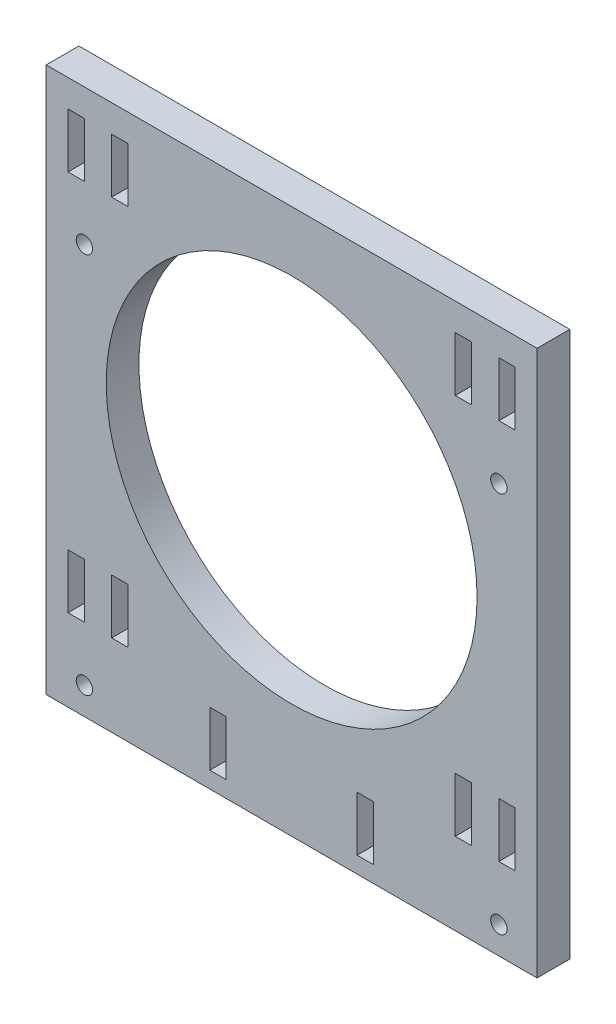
ISO-10303-21;
HEADER;
FILE_DESCRIPTION(('STEP AP214'),'2;1');
FILE_NAME('part.step','',(''),(''),'','','');
FILE_SCHEMA(('AUTOMOTIVE_DESIGN { 1 0 10303 214 1 1 1 1 }'));
ENDSEC;
DATA;
#1=APPLICATION_CONTEXT('core data for automotive mechanical design processes');
#2=APPLICATION_PROTOCOL_DEFINITION('international standard','automotive_design',2000,#1);
#3=PRODUCT_CONTEXT('',#1,'mechanical');
#4=PRODUCT('Part','Part','',(#3));
#5=PRODUCT_RELATED_PRODUCT_CATEGORY('part','',(#4));
#6=PRODUCT_DEFINITION_FORMATION('','',#4);
#7=PRODUCT_DEFINITION_CONTEXT('part definition',#1,'design');
#8=PRODUCT_DEFINITION('design','',#6,#7);
#9=PRODUCT_DEFINITION_SHAPE('','',#8);
#10=(LENGTH_UNIT() NAMED_UNIT(*) SI_UNIT(.MILLI.,.METRE.));
#11=(NAMED_UNIT(*) PLANE_ANGLE_UNIT() SI_UNIT($,.RADIAN.));
#12=(NAMED_UNIT(*) SI_UNIT($,.STERADIAN.) SOLID_ANGLE_UNIT());
#13=UNCERTAINTY_MEASURE_WITH_UNIT(LENGTH_MEASURE(1.E-05),#10,'distance_accuracy_value','');
#14=(GEOMETRIC_REPRESENTATION_CONTEXT(3) GLOBAL_UNCERTAINTY_ASSIGNED_CONTEXT((#13)) GLOBAL_UNIT_ASSIGNED_CONTEXT((#10,
#11,#12)) REPRESENTATION_CONTEXT('',''));
#15=CARTESIAN_POINT('',(0.,0.,0.));
#16=DIRECTION('',(0.,0.,1.));
#17=DIRECTION('',(1.,0.,0.));
#18=AXIS2_PLACEMENT_3D('',#15,#16,#17);
#19=CARTESIAN_POINT('',(44.9999999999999,1.2490009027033E-13,6.));
#20=DIRECTION('',(1.,0.,0.));
#21=DIRECTION('',(0.,1.,0.));
#22=AXIS2_PLACEMENT_3D('',#19,#20,#21);
#23=PLANE('',#22);
#24=DIRECTION('',(0.,-1.,0.));
#25=VECTOR('',#24,1.);
#26=CARTESIAN_POINT('',(44.9999999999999,1.2490009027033E-13,0.));
#27=LINE('',#26,#25);
#28=CARTESIAN_POINT('',(45.,45.,0.));
#29=VERTEX_POINT('',#28);
#30=CARTESIAN_POINT('',(45.,-55.,0.));
#31=VERTEX_POINT('',#30);
#32=EDGE_CURVE('E609',#29,#31,#27,.T.);
#33=ORIENTED_EDGE('',*,*,#32,.F.);
#34=DIRECTION('',(0.,0.,-1.));
#35=VECTOR('',#34,1.);
#36=CARTESIAN_POINT('',(45.,45.,6.));
#37=LINE('',#36,#35);
#38=CARTESIAN_POINT('',(45.,45.,6.));
#39=VERTEX_POINT('',#38);
#40=EDGE_CURVE('E625',#39,#29,#37,.T.);
#41=ORIENTED_EDGE('',*,*,#40,.F.);
#42=DIRECTION('',(0.,-1.,0.));
#43=VECTOR('',#42,1.);
#44=CARTESIAN_POINT('',(44.9999999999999,1.2490009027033E-13,6.));
#45=LINE('',#44,#43);
#46=CARTESIAN_POINT('',(45.,-55.,6.));
#47=VERTEX_POINT('',#46);
#48=EDGE_CURVE('E594',#39,#47,#45,.T.);
#49=ORIENTED_EDGE('',*,*,#48,.T.);
#50=DIRECTION('',(0.,0.,-1.));
#51=VECTOR('',#50,1.);
#52=CARTESIAN_POINT('',(45.,-55.,6.));
#53=LINE('',#52,#51);
#54=EDGE_CURVE('E606',#47,#31,#53,.T.);
#55=ORIENTED_EDGE('',*,*,#54,.T.);
#56=EDGE_LOOP('',(#33,#41,#49,#55));
#57=FACE_BOUND('',#56,.T.);
#58=ADVANCED_FACE('F34',(#57),#23,.T.);
#59=CARTESIAN_POINT('',(0.,45.,6.));
#60=DIRECTION('',(0.,1.,0.));
#61=DIRECTION('',(0.,0.,1.));
#62=AXIS2_PLACEMENT_3D('',#59,#60,#61);
#63=PLANE('',#62);
#64=DIRECTION('',(1.,0.,0.));
#65=VECTOR('',#64,1.);
#66=CARTESIAN_POINT('',(0.,45.,0.));
#67=LINE('',#66,#65);
#68=CARTESIAN_POINT('',(-45.,45.,0.));
#69=VERTEX_POINT('',#68);
#70=EDGE_CURVE('E612',#69,#29,#67,.T.);
#71=ORIENTED_EDGE('',*,*,#70,.F.);
#72=DIRECTION('',(0.,0.,-1.));
#73=VECTOR('',#72,1.);
#74=CARTESIAN_POINT('',(-45.,45.,6.));
#75=LINE('',#74,#73);
#76=CARTESIAN_POINT('',(-45.,45.,6.));
#77=VERTEX_POINT('',#76);
#78=EDGE_CURVE('E623',#77,#69,#75,.T.);
#79=ORIENTED_EDGE('',*,*,#78,.F.);
#80=DIRECTION('',(1.,0.,0.));
#81=VECTOR('',#80,1.);
#82=CARTESIAN_POINT('',(0.,45.,6.));
#83=LINE('',#82,#81);
#84=EDGE_CURVE('E598',#77,#39,#83,.T.);
#85=ORIENTED_EDGE('',*,*,#84,.T.);
#86=ORIENTED_EDGE('',*,*,#40,.T.);
#87=EDGE_LOOP('',(#71,#79,#85,#86));
#88=FACE_BOUND('',#87,.T.);
#89=ADVANCED_FACE('F732',(#88),#63,.T.);
#90=CARTESIAN_POINT('',(-45.,0.,6.));
#91=DIRECTION('',(-1.,0.,0.));
#92=DIRECTION('',(0.,-1.,0.));
#93=AXIS2_PLACEMENT_3D('',#90,#91,#92);
#94=PLANE('',#93);
#95=DIRECTION('',(0.,1.,0.));
#96=VECTOR('',#95,1.);
#97=CARTESIAN_POINT('',(-45.,0.,0.));
#98=LINE('',#97,#96);
#99=CARTESIAN_POINT('',(-45.,-55.,0.));
#100=VERTEX_POINT('',#99);
#101=EDGE_CURVE('E615',#100,#69,#98,.T.);
#102=ORIENTED_EDGE('',*,*,#101,.F.);
#103=DIRECTION('',(0.,0.,-1.));
#104=VECTOR('',#103,1.);
#105=CARTESIAN_POINT('',(-45.,-55.,6.));
#106=LINE('',#105,#104);
#107=CARTESIAN_POINT('',(-45.,-55.,6.));
#108=VERTEX_POINT('',#107);
#109=EDGE_CURVE('E621',#108,#100,#106,.T.);
#110=ORIENTED_EDGE('',*,*,#109,.F.);
#111=DIRECTION('',(0.,1.,0.));
#112=VECTOR('',#111,1.);
#113=CARTESIAN_POINT('',(-45.,0.,6.));
#114=LINE('',#113,#112);
#115=EDGE_CURVE('E601',#108,#77,#114,.T.);
#116=ORIENTED_EDGE('',*,*,#115,.T.);
#117=ORIENTED_EDGE('',*,*,#78,.T.);
#118=EDGE_LOOP('',(#102,#110,#116,#117));
#119=FACE_BOUND('',#118,.T.);
#120=ADVANCED_FACE('F737',(#119),#94,.T.);
#121=CARTESIAN_POINT('',(0.,0.,6.));
#122=DIRECTION('',(0.,0.,-1.));
#123=DIRECTION('',(-1.,0.,0.));
#124=AXIS2_PLACEMENT_3D('',#121,#122,#123);
#125=CYLINDRICAL_SURFACE('',#124,33.9999999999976);
#126=CARTESIAN_POINT('',(0.,0.,6.));
#127=DIRECTION('',(0.,0.,1.));
#128=DIRECTION('',(1.,0.,0.));
#129=AXIS2_PLACEMENT_3D('',#126,#127,#128);
#130=CIRCLE('',#129,33.9999999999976);
#131=CARTESIAN_POINT('',(33.9999999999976,0.,6.));
#132=VERTEX_POINT('',#131);
#133=EDGE_CURVE('E591',#132,#132,#130,.T.);
#134=ORIENTED_EDGE('',*,*,#133,.T.);
#135=EDGE_LOOP('',(#134));
#136=FACE_BOUND('',#135,.T.);
#137=CARTESIAN_POINT('',(0.,0.,0.));
#138=DIRECTION('',(0.,0.,1.));
#139=DIRECTION('',(1.,0.,0.));
#140=AXIS2_PLACEMENT_3D('',#137,#138,#139);
#141=CIRCLE('',#140,33.9999999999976);
#142=CARTESIAN_POINT('',(33.9999999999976,0.,0.));
#143=VERTEX_POINT('',#142);
#144=EDGE_CURVE('E584',#143,#143,#141,.T.);
#145=ORIENTED_EDGE('',*,*,#144,.F.);
#146=EDGE_LOOP('',(#145));
#147=FACE_BOUND('',#146,.T.);
#148=ADVANCED_FACE('F36',(#136,#147),#125,.F.);
#149=CARTESIAN_POINT('',(0.,-55.,6.));
#150=DIRECTION('',(0.,1.,0.));
#151=DIRECTION('',(0.,0.,1.));
#152=AXIS2_PLACEMENT_3D('',#149,#150,#151);
#153=PLANE('',#152);
#154=DIRECTION('',(1.,0.,0.));
#155=VECTOR('',#154,1.);
#156=CARTESIAN_POINT('',(0.,-55.,0.));
#157=LINE('',#156,#155);
#158=EDGE_CURVE('E595',#100,#31,#157,.T.);
#159=ORIENTED_EDGE('',*,*,#158,.T.);
#160=ORIENTED_EDGE('',*,*,#54,.F.);
#161=DIRECTION('',(1.,0.,0.));
#162=VECTOR('',#161,1.);
#163=CARTESIAN_POINT('',(0.,-55.,6.));
#164=LINE('',#163,#162);
#165=EDGE_CURVE('E604',#108,#47,#164,.T.);
#166=ORIENTED_EDGE('',*,*,#165,.F.);
#167=ORIENTED_EDGE('',*,*,#109,.T.);
#168=EDGE_LOOP('',(#159,#160,#166,#167));
#169=FACE_BOUND('',#168,.T.);
#170=ADVANCED_FACE('F745',(#169),#153,.F.);
#171=CARTESIAN_POINT('',(0.,0.,6.));
#172=DIRECTION('',(0.,0.,1.));
#173=DIRECTION('',(1.,0.,0.));
#174=AXIS2_PLACEMENT_3D('',#171,#172,#173);
#175=PLANE('',#174);
#176=DIRECTION('',(-1.,0.,0.));
#177=VECTOR('',#176,1.);
#178=CARTESIAN_POINT('',(-15.,-42.,6.));
#179=LINE('',#178,#177);
#180=CARTESIAN_POINT('',(-12.,-42.,6.));
#181=VERTEX_POINT('',#180);
#182=CARTESIAN_POINT('',(-15.,-42.,6.));
#183=VERTEX_POINT('',#182);
#184=EDGE_CURVE('E49',#181,#183,#179,.T.);
#185=ORIENTED_EDGE('',*,*,#184,.F.);
#186=DIRECTION('',(0.,1.,0.));
#187=VECTOR('',#186,1.);
#188=CARTESIAN_POINT('',(-12.,-52.,6.));
#189=LINE('',#188,#187);
#190=CARTESIAN_POINT('',(-12.,-52.,6.));
#191=VERTEX_POINT('',#190);
#192=EDGE_CURVE('E366',#191,#181,#189,.T.);
#193=ORIENTED_EDGE('',*,*,#192,.F.);
#194=DIRECTION('',(1.,0.,0.));
#195=VECTOR('',#194,1.);
#196=CARTESIAN_POINT('',(-15.,-52.,6.));
#197=LINE('',#196,#195);
#198=CARTESIAN_POINT('',(-15.,-52.,6.));
#199=VERTEX_POINT('',#198);
#200=EDGE_CURVE('E363',#199,#191,#197,.T.);
#201=ORIENTED_EDGE('',*,*,#200,.F.);
#202=DIRECTION('',(0.,-1.,0.));
#203=VECTOR('',#202,1.);
#204=CARTESIAN_POINT('',(-15.,-42.,6.));
#205=LINE('',#204,#203);
#206=EDGE_CURVE('E359',#183,#199,#205,.T.);
#207=ORIENTED_EDGE('',*,*,#206,.F.);
#208=EDGE_LOOP('',(#185,#193,#201,#207));
#209=FACE_BOUND('',#208,.T.);
#210=CARTESIAN_POINT('',(-38.,20.,6.));
#211=DIRECTION('',(0.,0.,1.));
#212=DIRECTION('',(1.,0.,0.));
#213=AXIS2_PLACEMENT_3D('',#210,#211,#212);
#214=CIRCLE('',#213,1.5);
#215=CARTESIAN_POINT('',(-36.5,20.,6.));
#216=VERTEX_POINT('',#215);
#217=EDGE_CURVE('E353',#216,#216,#214,.T.);
#218=ORIENTED_EDGE('',*,*,#217,.F.);
#219=EDGE_LOOP('',(#218));
#220=FACE_BOUND('',#219,.T.);
#221=CARTESIAN_POINT('',(-38.,-50.,6.));
#222=DIRECTION('',(0.,0.,1.));
#223=DIRECTION('',(1.,0.,0.));
#224=AXIS2_PLACEMENT_3D('',#221,#222,#223);
#225=CIRCLE('',#224,1.5);
#226=CARTESIAN_POINT('',(-36.5,-50.,6.));
#227=VERTEX_POINT('',#226);
#228=EDGE_CURVE('E356',#227,#227,#225,.T.);
#229=ORIENTED_EDGE('',*,*,#228,.F.);
#230=EDGE_LOOP('',(#229));
#231=FACE_BOUND('',#230,.T.);
#232=DIRECTION('',(0.,1.,0.));
#233=VECTOR('',#232,1.);
#234=CARTESIAN_POINT('',(-38.,30.,6.));
#235=LINE('',#234,#233);
#236=CARTESIAN_POINT('',(-38.,30.,6.));
#237=VERTEX_POINT('',#236);
#238=CARTESIAN_POINT('',(-38.,40.,6.));
#239=VERTEX_POINT('',#238);
#240=EDGE_CURVE('E57',#237,#239,#235,.T.);
#241=ORIENTED_EDGE('',*,*,#240,.F.);
#242=DIRECTION('',(1.,0.,0.));
#243=VECTOR('',#242,1.);
#244=CARTESIAN_POINT('',(-41.,30.,6.));
#245=LINE('',#244,#243);
#246=CARTESIAN_POINT('',(-41.,30.,6.));
#247=VERTEX_POINT('',#246);
#248=EDGE_CURVE('E383',#247,#237,#245,.T.);
#249=ORIENTED_EDGE('',*,*,#248,.F.);
#250=DIRECTION('',(0.,-1.,0.));
#251=VECTOR('',#250,1.);
#252=CARTESIAN_POINT('',(-41.,40.,6.));
#253=LINE('',#252,#251);
#254=CARTESIAN_POINT('',(-41.,40.,6.));
#255=VERTEX_POINT('',#254);
#256=EDGE_CURVE('E380',#255,#247,#253,.T.);
#257=ORIENTED_EDGE('',*,*,#256,.F.);
#258=DIRECTION('',(-1.,0.,0.));
#259=VECTOR('',#258,1.);
#260=CARTESIAN_POINT('',(-38.,40.,6.));
#261=LINE('',#260,#259);
#262=EDGE_CURVE('E377',#239,#255,#261,.T.);
#263=ORIENTED_EDGE('',*,*,#262,.F.);
#264=EDGE_LOOP('',(#241,#249,#257,#263));
#265=FACE_BOUND('',#264,.T.);
#266=DIRECTION('',(0.,-1.,0.));
#267=VECTOR('',#266,1.);
#268=CARTESIAN_POINT('',(38.,30.,6.));
#269=LINE('',#268,#267);
#270=CARTESIAN_POINT('',(38.,40.,6.));
#271=VERTEX_POINT('',#270);
#272=CARTESIAN_POINT('',(38.,30.,6.));
#273=VERTEX_POINT('',#272);
#274=EDGE_CURVE('E350',#271,#273,#269,.T.);
#275=ORIENTED_EDGE('',*,*,#274,.F.);
#276=DIRECTION('',(-1.,0.,0.));
#277=VECTOR('',#276,1.);
#278=CARTESIAN_POINT('',(38.,40.,6.));
#279=LINE('',#278,#277);
#280=CARTESIAN_POINT('',(41.,40.,6.));
#281=VERTEX_POINT('',#280);
#282=EDGE_CURVE('E426',#281,#271,#279,.T.);
#283=ORIENTED_EDGE('',*,*,#282,.F.);
#284=DIRECTION('',(0.,1.,0.));
#285=VECTOR('',#284,1.);
#286=CARTESIAN_POINT('',(41.,40.,6.));
#287=LINE('',#286,#285);
#288=CARTESIAN_POINT('',(41.,30.,6.));
#289=VERTEX_POINT('',#288);
#290=EDGE_CURVE('E423',#289,#281,#287,.T.);
#291=ORIENTED_EDGE('',*,*,#290,.F.);
#292=DIRECTION('',(1.,0.,0.));
#293=VECTOR('',#292,1.);
#294=CARTESIAN_POINT('',(41.,30.,6.));
#295=LINE('',#294,#293);
#296=EDGE_CURVE('E420',#273,#289,#295,.T.);
#297=ORIENTED_EDGE('',*,*,#296,.F.);
#298=EDGE_LOOP('',(#275,#283,#291,#297));
#299=FACE_BOUND('',#298,.T.);
#300=DIRECTION('',(0.,1.,0.));
#301=VECTOR('',#300,1.);
#302=CARTESIAN_POINT('',(15.,-42.,6.));
#303=LINE('',#302,#301);
#304=CARTESIAN_POINT('',(15.,-52.,6.));
#305=VERTEX_POINT('',#304);
#306=CARTESIAN_POINT('',(15.,-42.,6.));
#307=VERTEX_POINT('',#306);
#308=EDGE_CURVE('E397',#305,#307,#303,.T.);
#309=ORIENTED_EDGE('',*,*,#308,.F.);
#310=DIRECTION('',(1.,0.,0.));
#311=VECTOR('',#310,1.);
#312=CARTESIAN_POINT('',(15.,-52.,6.));
#313=LINE('',#312,#311);
#314=CARTESIAN_POINT('',(12.,-52.,6.));
#315=VERTEX_POINT('',#314);
#316=EDGE_CURVE('E406',#315,#305,#313,.T.);
#317=ORIENTED_EDGE('',*,*,#316,.F.);
#318=DIRECTION('',(0.,-1.,0.));
#319=VECTOR('',#318,1.);
#320=CARTESIAN_POINT('',(12.,-52.,6.));
#321=LINE('',#320,#319);
#322=CARTESIAN_POINT('',(12.,-42.,6.));
#323=VERTEX_POINT('',#322);
#324=EDGE_CURVE('E403',#323,#315,#321,.T.);
#325=ORIENTED_EDGE('',*,*,#324,.F.);
#326=DIRECTION('',(-1.,0.,0.));
#327=VECTOR('',#326,1.);
#328=CARTESIAN_POINT('',(15.,-42.,6.));
#329=LINE('',#328,#327);
#330=EDGE_CURVE('E399',#307,#323,#329,.T.);
#331=ORIENTED_EDGE('',*,*,#330,.F.);
#332=EDGE_LOOP('',(#309,#317,#325,#331));
#333=FACE_BOUND('',#332,.T.);
#334=CARTESIAN_POINT('',(38.,-50.,6.));
#335=DIRECTION('',(0.,0.,1.));
#336=DIRECTION('',(-1.,0.,0.));
#337=AXIS2_PLACEMENT_3D('',#334,#335,#336);
#338=CIRCLE('',#337,1.5);
#339=CARTESIAN_POINT('',(36.5,-50.,6.));
#340=VERTEX_POINT('',#339);
#341=EDGE_CURVE('E412',#340,#340,#338,.T.);
#342=ORIENTED_EDGE('',*,*,#341,.F.);
#343=EDGE_LOOP('',(#342));
#344=FACE_BOUND('',#343,.T.);
#345=CARTESIAN_POINT('',(38.,20.,6.));
#346=DIRECTION('',(0.,0.,1.));
#347=DIRECTION('',(-1.,0.,0.));
#348=AXIS2_PLACEMENT_3D('',#345,#346,#347);
#349=CIRCLE('',#348,1.5);
#350=CARTESIAN_POINT('',(36.5,20.,6.));
#351=VERTEX_POINT('',#350);
#352=EDGE_CURVE('E360',#351,#351,#349,.T.);
#353=ORIENTED_EDGE('',*,*,#352,.F.);
#354=EDGE_LOOP('',(#353));
#355=FACE_BOUND('',#354,.T.);
#356=DIRECTION('',(0.,1.,0.));
#357=VECTOR('',#356,1.);
#358=CARTESIAN_POINT('',(41.,-40.,6.));
#359=LINE('',#358,#357);
#360=CARTESIAN_POINT('',(41.,-40.,6.));
#361=VERTEX_POINT('',#360);
#362=CARTESIAN_POINT('',(41.,-30.,6.));
#363=VERTEX_POINT('',#362);
#364=EDGE_CURVE('E338',#361,#363,#359,.T.);
#365=ORIENTED_EDGE('',*,*,#364,.F.);
#366=DIRECTION('',(1.,0.,0.));
#367=VECTOR('',#366,1.);
#368=CARTESIAN_POINT('',(38.,-40.,6.));
#369=LINE('',#368,#367);
#370=CARTESIAN_POINT('',(38.,-40.,6.));
#371=VERTEX_POINT('',#370);
#372=EDGE_CURVE('E343',#371,#361,#369,.T.);
#373=ORIENTED_EDGE('',*,*,#372,.F.);
#374=DIRECTION('',(0.,-1.,0.));
#375=VECTOR('',#374,1.);
#376=CARTESIAN_POINT('',(38.,-30.,6.));
#377=LINE('',#376,#375);
#378=CARTESIAN_POINT('',(38.,-30.,6.));
#379=VERTEX_POINT('',#378);
#380=EDGE_CURVE('E322',#379,#371,#377,.T.);
#381=ORIENTED_EDGE('',*,*,#380,.F.);
#382=DIRECTION('',(-1.,0.,0.));
#383=VECTOR('',#382,1.);
#384=CARTESIAN_POINT('',(41.,-30.,6.));
#385=LINE('',#384,#383);
#386=EDGE_CURVE('E333',#363,#379,#385,.T.);
#387=ORIENTED_EDGE('',*,*,#386,.F.);
#388=EDGE_LOOP('',(#365,#373,#381,#387));
#389=FACE_BOUND('',#388,.T.);
#390=DIRECTION('',(-1.,0.,0.));
#391=VECTOR('',#390,1.);
#392=CARTESIAN_POINT('',(-41.,-30.,6.));
#393=LINE('',#392,#391);
#394=CARTESIAN_POINT('',(-38.,-30.,6.));
#395=VERTEX_POINT('',#394);
#396=CARTESIAN_POINT('',(-41.,-30.,6.));
#397=VERTEX_POINT('',#396);
#398=EDGE_CURVE('E389',#395,#397,#393,.T.);
#399=ORIENTED_EDGE('',*,*,#398,.F.);
#400=DIRECTION('',(0.,1.,0.));
#401=VECTOR('',#400,1.);
#402=CARTESIAN_POINT('',(-38.,-30.,6.));
#403=LINE('',#402,#401);
#404=CARTESIAN_POINT('',(-38.,-40.,6.));
#405=VERTEX_POINT('',#404);
#406=EDGE_CURVE('E448',#405,#395,#403,.T.);
#407=ORIENTED_EDGE('',*,*,#406,.F.);
#408=DIRECTION('',(1.,0.,0.));
#409=VECTOR('',#408,1.);
#410=CARTESIAN_POINT('',(-38.,-40.,6.));
#411=LINE('',#410,#409);
#412=CARTESIAN_POINT('',(-41.,-40.,6.));
#413=VERTEX_POINT('',#412);
#414=EDGE_CURVE('E445',#413,#405,#411,.T.);
#415=ORIENTED_EDGE('',*,*,#414,.F.);
#416=DIRECTION('',(0.,-1.,0.));
#417=VECTOR('',#416,1.);
#418=CARTESIAN_POINT('',(-41.,-40.,6.));
#419=LINE('',#418,#417);
#420=EDGE_CURVE('E442',#397,#413,#419,.T.);
#421=ORIENTED_EDGE('',*,*,#420,.F.);
#422=EDGE_LOOP('',(#399,#407,#415,#421));
#423=FACE_BOUND('',#422,.T.);
#424=DIRECTION('',(-1.,0.,0.));
#425=VECTOR('',#424,1.);
#426=CARTESIAN_POINT('',(33.,40.,6.));
#427=LINE('',#426,#425);
#428=CARTESIAN_POINT('',(33.,40.,6.));
#429=VERTEX_POINT('',#428);
#430=CARTESIAN_POINT('',(30.,40.,6.));
#431=VERTEX_POINT('',#430);
#432=EDGE_CURVE('E509',#429,#431,#427,.T.);
#433=ORIENTED_EDGE('',*,*,#432,.F.);
#434=DIRECTION('',(0.,1.,0.));
#435=VECTOR('',#434,1.);
#436=CARTESIAN_POINT('',(33.,30.,6.));
#437=LINE('',#436,#435);
#438=CARTESIAN_POINT('',(33.,30.,6.));
#439=VERTEX_POINT('',#438);
#440=EDGE_CURVE('E499',#439,#429,#437,.T.);
#441=ORIENTED_EDGE('',*,*,#440,.F.);
#442=DIRECTION('',(1.,0.,0.));
#443=VECTOR('',#442,1.);
#444=CARTESIAN_POINT('',(30.,30.,6.));
#445=LINE('',#444,#443);
#446=CARTESIAN_POINT('',(30.,30.,6.));
#447=VERTEX_POINT('',#446);
#448=EDGE_CURVE('E515',#447,#439,#445,.T.);
#449=ORIENTED_EDGE('',*,*,#448,.F.);
#450=DIRECTION('',(0.,-1.,0.));
#451=VECTOR('',#450,1.);
#452=CARTESIAN_POINT('',(30.,40.,6.));
#453=LINE('',#452,#451);
#454=EDGE_CURVE('E511',#431,#447,#453,.T.);
#455=ORIENTED_EDGE('',*,*,#454,.F.);
#456=EDGE_LOOP('',(#433,#441,#449,#455));
#457=FACE_BOUND('',#456,.T.);
#458=DIRECTION('',(-1.,0.,0.));
#459=VECTOR('',#458,1.);
#460=CARTESIAN_POINT('',(-30.,-30.,6.));
#461=LINE('',#460,#459);
#462=CARTESIAN_POINT('',(-30.,-30.,6.));
#463=VERTEX_POINT('',#462);
#464=CARTESIAN_POINT('',(-33.,-30.,6.));
#465=VERTEX_POINT('',#464);
#466=EDGE_CURVE('E488',#463,#465,#461,.T.);
#467=ORIENTED_EDGE('',*,*,#466,.F.);
#468=DIRECTION('',(0.,1.,0.));
#469=VECTOR('',#468,1.);
#470=CARTESIAN_POINT('',(-30.,-40.,6.));
#471=LINE('',#470,#469);
#472=CARTESIAN_POINT('',(-30.,-40.,6.));
#473=VERTEX_POINT('',#472);
#474=EDGE_CURVE('E533',#473,#463,#471,.T.);
#475=ORIENTED_EDGE('',*,*,#474,.F.);
#476=DIRECTION('',(1.,0.,0.));
#477=VECTOR('',#476,1.);
#478=CARTESIAN_POINT('',(-33.,-40.,6.));
#479=LINE('',#478,#477);
#480=CARTESIAN_POINT('',(-33.,-40.,6.));
#481=VERTEX_POINT('',#480);
#482=EDGE_CURVE('E547',#481,#473,#479,.T.);
#483=ORIENTED_EDGE('',*,*,#482,.F.);
#484=DIRECTION('',(0.,-1.,0.));
#485=VECTOR('',#484,1.);
#486=CARTESIAN_POINT('',(-33.,-30.,6.));
#487=LINE('',#486,#485);
#488=EDGE_CURVE('E544',#465,#481,#487,.T.);
#489=ORIENTED_EDGE('',*,*,#488,.F.);
#490=EDGE_LOOP('',(#467,#475,#483,#489));
#491=FACE_BOUND('',#490,.T.);
#492=DIRECTION('',(-1.,0.,0.));
#493=VECTOR('',#492,1.);
#494=CARTESIAN_POINT('',(33.,-30.,6.));
#495=LINE('',#494,#493);
#496=CARTESIAN_POINT('',(33.,-30.,6.));
#497=VERTEX_POINT('',#496);
#498=CARTESIAN_POINT('',(30.,-30.,6.));
#499=VERTEX_POINT('',#498);
#500=EDGE_CURVE('E475',#497,#499,#495,.T.);
#501=ORIENTED_EDGE('',*,*,#500,.F.);
#502=DIRECTION('',(0.,1.,0.));
#503=VECTOR('',#502,1.);
#504=CARTESIAN_POINT('',(33.,-40.,6.));
#505=LINE('',#504,#503);
#506=CARTESIAN_POINT('',(33.,-40.,6.));
#507=VERTEX_POINT('',#506);
#508=EDGE_CURVE('E465',#507,#497,#505,.T.);
#509=ORIENTED_EDGE('',*,*,#508,.F.);
#510=DIRECTION('',(1.,0.,0.));
#511=VECTOR('',#510,1.);
#512=CARTESIAN_POINT('',(30.,-40.,6.));
#513=LINE('',#512,#511);
#514=CARTESIAN_POINT('',(30.,-40.,6.));
#515=VERTEX_POINT('',#514);
#516=EDGE_CURVE('E481',#515,#507,#513,.T.);
#517=ORIENTED_EDGE('',*,*,#516,.F.);
#518=DIRECTION('',(0.,-1.,0.));
#519=VECTOR('',#518,1.);
#520=CARTESIAN_POINT('',(30.,-30.,6.));
#521=LINE('',#520,#519);
#522=EDGE_CURVE('E477',#499,#515,#521,.T.);
#523=ORIENTED_EDGE('',*,*,#522,.F.);
#524=EDGE_LOOP('',(#501,#509,#517,#523));
#525=FACE_BOUND('',#524,.T.);
#526=DIRECTION('',(-1.,0.,0.));
#527=VECTOR('',#526,1.);
#528=CARTESIAN_POINT('',(-30.,40.,6.));
#529=LINE('',#528,#527);
#530=CARTESIAN_POINT('',(-30.,40.,6.));
#531=VERTEX_POINT('',#530);
#532=CARTESIAN_POINT('',(-33.,40.,6.));
#533=VERTEX_POINT('',#532);
#534=EDGE_CURVE('E522',#531,#533,#529,.T.);
#535=ORIENTED_EDGE('',*,*,#534,.F.);
#536=DIRECTION('',(0.,1.,0.));
#537=VECTOR('',#536,1.);
#538=CARTESIAN_POINT('',(-30.,30.,6.));
#539=LINE('',#538,#537);
#540=CARTESIAN_POINT('',(-30.,30.,6.));
#541=VERTEX_POINT('',#540);
#542=EDGE_CURVE('E563',#541,#531,#539,.T.);
#543=ORIENTED_EDGE('',*,*,#542,.F.);
#544=DIRECTION('',(1.,0.,0.));
#545=VECTOR('',#544,1.);
#546=CARTESIAN_POINT('',(-33.,30.,6.));
#547=LINE('',#546,#545);
#548=CARTESIAN_POINT('',(-33.,30.,6.));
#549=VERTEX_POINT('',#548);
#550=EDGE_CURVE('E577',#549,#541,#547,.T.);
#551=ORIENTED_EDGE('',*,*,#550,.F.);
#552=DIRECTION('',(0.,-1.,0.));
#553=VECTOR('',#552,1.);
#554=CARTESIAN_POINT('',(-33.,40.,6.));
#555=LINE('',#554,#553);
#556=EDGE_CURVE('E574',#533,#549,#555,.T.);
#557=ORIENTED_EDGE('',*,*,#556,.F.);
#558=EDGE_LOOP('',(#535,#543,#551,#557));
#559=FACE_BOUND('',#558,.T.);
#560=ORIENTED_EDGE('',*,*,#133,.F.);
#561=EDGE_LOOP('',(#560));
#562=FACE_BOUND('',#561,.T.);
#563=ORIENTED_EDGE('',*,*,#48,.F.);
#564=ORIENTED_EDGE('',*,*,#84,.F.);
#565=ORIENTED_EDGE('',*,*,#115,.F.);
#566=ORIENTED_EDGE('',*,*,#165,.T.);
#567=EDGE_LOOP('',(#563,#564,#565,#566));
#568=FACE_BOUND('',#567,.T.);
#569=ADVANCED_FACE('F340',(#209,#220,#231,#265,#299,#333,#344,#355,#389,#423,#457,#491,#525,
#559,#562,#568),#175,.T.);
#570=CARTESIAN_POINT('',(0.,0.,0.));
#571=DIRECTION('',(0.,0.,1.));
#572=DIRECTION('',(1.,0.,0.));
#573=AXIS2_PLACEMENT_3D('',#570,#571,#572);
#574=PLANE('',#573);
#575=DIRECTION('',(0.,1.,0.));
#576=VECTOR('',#575,1.);
#577=CARTESIAN_POINT('',(-12.,0.,0.));
#578=LINE('',#577,#576);
#579=CARTESIAN_POINT('',(-12.,-52.,0.));
#580=VERTEX_POINT('',#579);
#581=CARTESIAN_POINT('',(-12.,-42.,0.));
#582=VERTEX_POINT('',#581);
#583=EDGE_CURVE('E42',#580,#582,#578,.T.);
#584=ORIENTED_EDGE('',*,*,#583,.T.);
#585=DIRECTION('',(-1.,0.,0.));
#586=VECTOR('',#585,1.);
#587=CARTESIAN_POINT('',(0.,-42.,0.));
#588=LINE('',#587,#586);
#589=CARTESIAN_POINT('',(-15.,-42.,0.));
#590=VERTEX_POINT('',#589);
#591=EDGE_CURVE('E11',#582,#590,#588,.T.);
#592=ORIENTED_EDGE('',*,*,#591,.T.);
#593=DIRECTION('',(0.,-1.,0.));
#594=VECTOR('',#593,1.);
#595=CARTESIAN_POINT('',(-15.,0.,0.));
#596=LINE('',#595,#594);
#597=CARTESIAN_POINT('',(-15.,-52.,0.));
#598=VERTEX_POINT('',#597);
#599=EDGE_CURVE('E690',#590,#598,#596,.T.);
#600=ORIENTED_EDGE('',*,*,#599,.T.);
#601=DIRECTION('',(1.,0.,0.));
#602=VECTOR('',#601,1.);
#603=CARTESIAN_POINT('',(0.,-52.,0.));
#604=LINE('',#603,#602);
#605=EDGE_CURVE('E697',#598,#580,#604,.T.);
#606=ORIENTED_EDGE('',*,*,#605,.T.);
#607=EDGE_LOOP('',(#584,#592,#600,#606));
#608=FACE_BOUND('',#607,.T.);
#609=CARTESIAN_POINT('',(-38.,20.,0.));
#610=DIRECTION('',(0.,0.,1.));
#611=DIRECTION('',(1.,0.,0.));
#612=AXIS2_PLACEMENT_3D('',#609,#610,#611);
#613=CIRCLE('',#612,1.5);
#614=CARTESIAN_POINT('',(-36.5,20.,0.));
#615=VERTEX_POINT('',#614);
#616=EDGE_CURVE('E478',#615,#615,#613,.T.);
#617=ORIENTED_EDGE('',*,*,#616,.T.);
#618=EDGE_LOOP('',(#617));
#619=FACE_BOUND('',#618,.T.);
#620=CARTESIAN_POINT('',(-38.,-50.,0.));
#621=DIRECTION('',(0.,0.,1.));
#622=DIRECTION('',(1.,0.,0.));
#623=AXIS2_PLACEMENT_3D('',#620,#621,#622);
#624=CIRCLE('',#623,1.5);
#625=CARTESIAN_POINT('',(-36.5,-50.,0.));
#626=VERTEX_POINT('',#625);
#627=EDGE_CURVE('E654',#626,#626,#624,.T.);
#628=ORIENTED_EDGE('',*,*,#627,.T.);
#629=EDGE_LOOP('',(#628));
#630=FACE_BOUND('',#629,.T.);
#631=DIRECTION('',(1.,0.,0.));
#632=VECTOR('',#631,1.);
#633=CARTESIAN_POINT('',(0.,30.,0.));
#634=LINE('',#633,#632);
#635=CARTESIAN_POINT('',(-41.,30.,0.));
#636=VERTEX_POINT('',#635);
#637=CARTESIAN_POINT('',(-38.,30.,0.));
#638=VERTEX_POINT('',#637);
#639=EDGE_CURVE('E684',#636,#638,#634,.T.);
#640=ORIENTED_EDGE('',*,*,#639,.T.);
#641=DIRECTION('',(0.,1.,0.));
#642=VECTOR('',#641,1.);
#643=CARTESIAN_POINT('',(-38.,0.,0.));
#644=LINE('',#643,#642);
#645=CARTESIAN_POINT('',(-38.,40.,0.));
#646=VERTEX_POINT('',#645);
#647=EDGE_CURVE('E687',#638,#646,#644,.T.);
#648=ORIENTED_EDGE('',*,*,#647,.T.);
#649=DIRECTION('',(-1.,0.,0.));
#650=VECTOR('',#649,1.);
#651=CARTESIAN_POINT('',(0.,40.,0.));
#652=LINE('',#651,#650);
#653=CARTESIAN_POINT('',(-41.,40.,0.));
#654=VERTEX_POINT('',#653);
#655=EDGE_CURVE('E678',#646,#654,#652,.T.);
#656=ORIENTED_EDGE('',*,*,#655,.T.);
#657=DIRECTION('',(0.,-1.,0.));
#658=VECTOR('',#657,1.);
#659=CARTESIAN_POINT('',(-41.,0.,0.));
#660=LINE('',#659,#658);
#661=EDGE_CURVE('E681',#654,#636,#660,.T.);
#662=ORIENTED_EDGE('',*,*,#661,.T.);
#663=EDGE_LOOP('',(#640,#648,#656,#662));
#664=FACE_BOUND('',#663,.T.);
#665=DIRECTION('',(-1.,0.,0.));
#666=VECTOR('',#665,1.);
#667=CARTESIAN_POINT('',(0.,40.,0.));
#668=LINE('',#667,#666);
#669=CARTESIAN_POINT('',(41.,40.,0.));
#670=VERTEX_POINT('',#669);
#671=CARTESIAN_POINT('',(38.,40.,0.));
#672=VERTEX_POINT('',#671);
#673=EDGE_CURVE('E672',#670,#672,#668,.T.);
#674=ORIENTED_EDGE('',*,*,#673,.T.);
#675=DIRECTION('',(0.,-1.,0.));
#676=VECTOR('',#675,1.);
#677=CARTESIAN_POINT('',(38.,0.,0.));
#678=LINE('',#677,#676);
#679=CARTESIAN_POINT('',(38.,30.,0.));
#680=VERTEX_POINT('',#679);
#681=EDGE_CURVE('E675',#672,#680,#678,.T.);
#682=ORIENTED_EDGE('',*,*,#681,.T.);
#683=DIRECTION('',(1.,0.,0.));
#684=VECTOR('',#683,1.);
#685=CARTESIAN_POINT('',(0.,30.,0.));
#686=LINE('',#685,#684);
#687=CARTESIAN_POINT('',(41.,30.,0.));
#688=VERTEX_POINT('',#687);
#689=EDGE_CURVE('E666',#680,#688,#686,.T.);
#690=ORIENTED_EDGE('',*,*,#689,.T.);
#691=DIRECTION('',(0.,1.,0.));
#692=VECTOR('',#691,1.);
#693=CARTESIAN_POINT('',(41.,0.,0.));
#694=LINE('',#693,#692);
#695=EDGE_CURVE('E669',#688,#670,#694,.T.);
#696=ORIENTED_EDGE('',*,*,#695,.T.);
#697=EDGE_LOOP('',(#674,#682,#690,#696));
#698=FACE_BOUND('',#697,.T.);
#699=DIRECTION('',(1.,0.,0.));
#700=VECTOR('',#699,1.);
#701=CARTESIAN_POINT('',(0.,-52.,0.));
#702=LINE('',#701,#700);
#703=CARTESIAN_POINT('',(12.,-52.,0.));
#704=VERTEX_POINT('',#703);
#705=CARTESIAN_POINT('',(15.,-52.,0.));
#706=VERTEX_POINT('',#705);
#707=EDGE_CURVE('E660',#704,#706,#702,.T.);
#708=ORIENTED_EDGE('',*,*,#707,.T.);
#709=DIRECTION('',(0.,1.,0.));
#710=VECTOR('',#709,1.);
#711=CARTESIAN_POINT('',(15.,0.,0.));
#712=LINE('',#711,#710);
#713=CARTESIAN_POINT('',(15.,-42.,0.));
#714=VERTEX_POINT('',#713);
#715=EDGE_CURVE('E663',#706,#714,#712,.T.);
#716=ORIENTED_EDGE('',*,*,#715,.T.);
#717=DIRECTION('',(-1.,0.,0.));
#718=VECTOR('',#717,1.);
#719=CARTESIAN_POINT('',(0.,-42.,0.));
#720=LINE('',#719,#718);
#721=CARTESIAN_POINT('',(12.,-42.,0.));
#722=VERTEX_POINT('',#721);
#723=EDGE_CURVE('E648',#714,#722,#720,.T.);
#724=ORIENTED_EDGE('',*,*,#723,.T.);
#725=DIRECTION('',(0.,-1.,0.));
#726=VECTOR('',#725,1.);
#727=CARTESIAN_POINT('',(12.,0.,0.));
#728=LINE('',#727,#726);
#729=EDGE_CURVE('E657',#722,#704,#728,.T.);
#730=ORIENTED_EDGE('',*,*,#729,.T.);
#731=EDGE_LOOP('',(#708,#716,#724,#730));
#732=FACE_BOUND('',#731,.T.);
#733=CARTESIAN_POINT('',(38.,-50.,0.));
#734=DIRECTION('',(0.,0.,1.));
#735=DIRECTION('',(1.,0.,0.));
#736=AXIS2_PLACEMENT_3D('',#733,#734,#735);
#737=CIRCLE('',#736,1.5);
#738=CARTESIAN_POINT('',(39.5,-50.,0.));
#739=VERTEX_POINT('',#738);
#740=EDGE_CURVE('E651',#739,#739,#737,.T.);
#741=ORIENTED_EDGE('',*,*,#740,.T.);
#742=EDGE_LOOP('',(#741));
#743=FACE_BOUND('',#742,.T.);
#744=CARTESIAN_POINT('',(38.,20.,0.));
#745=DIRECTION('',(0.,0.,1.));
#746=DIRECTION('',(1.,0.,0.));
#747=AXIS2_PLACEMENT_3D('',#744,#745,#746);
#748=CIRCLE('',#747,1.5);
#749=CARTESIAN_POINT('',(39.5,20.,0.));
#750=VERTEX_POINT('',#749);
#751=EDGE_CURVE('E454',#750,#750,#748,.T.);
#752=ORIENTED_EDGE('',*,*,#751,.T.);
#753=EDGE_LOOP('',(#752));
#754=FACE_BOUND('',#753,.T.);
#755=DIRECTION('',(1.,0.,0.));
#756=VECTOR('',#755,1.);
#757=CARTESIAN_POINT('',(0.,-40.,0.));
#758=LINE('',#757,#756);
#759=CARTESIAN_POINT('',(38.,-40.,0.));
#760=VERTEX_POINT('',#759);
#761=CARTESIAN_POINT('',(41.,-40.,0.));
#762=VERTEX_POINT('',#761);
#763=EDGE_CURVE('E642',#760,#762,#758,.T.);
#764=ORIENTED_EDGE('',*,*,#763,.T.);
#765=DIRECTION('',(0.,1.,0.));
#766=VECTOR('',#765,1.);
#767=CARTESIAN_POINT('',(40.9999999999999,0.,0.));
#768=LINE('',#767,#766);
#769=CARTESIAN_POINT('',(41.,-30.,0.));
#770=VERTEX_POINT('',#769);
#771=EDGE_CURVE('E645',#762,#770,#768,.T.);
#772=ORIENTED_EDGE('',*,*,#771,.T.);
#773=DIRECTION('',(-1.,0.,0.));
#774=VECTOR('',#773,1.);
#775=CARTESIAN_POINT('',(0.,-30.,0.));
#776=LINE('',#775,#774);
#777=CARTESIAN_POINT('',(38.,-30.,0.));
#778=VERTEX_POINT('',#777);
#779=EDGE_CURVE('E639',#770,#778,#776,.T.);
#780=ORIENTED_EDGE('',*,*,#779,.T.);
#781=DIRECTION('',(0.,-1.,0.));
#782=VECTOR('',#781,1.);
#783=CARTESIAN_POINT('',(37.9999999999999,0.,0.));
#784=LINE('',#783,#782);
#785=EDGE_CURVE('E325',#778,#760,#784,.T.);
#786=ORIENTED_EDGE('',*,*,#785,.T.);
#787=EDGE_LOOP('',(#764,#772,#780,#786));
#788=FACE_BOUND('',#787,.T.);
#789=DIRECTION('',(0.,1.,0.));
#790=VECTOR('',#789,1.);
#791=CARTESIAN_POINT('',(-38.,0.,0.));
#792=LINE('',#791,#790);
#793=CARTESIAN_POINT('',(-38.,-40.,0.));
#794=VERTEX_POINT('',#793);
#795=CARTESIAN_POINT('',(-38.,-30.,0.));
#796=VERTEX_POINT('',#795);
#797=EDGE_CURVE('E633',#794,#796,#792,.T.);
#798=ORIENTED_EDGE('',*,*,#797,.T.);
#799=DIRECTION('',(-1.,0.,0.));
#800=VECTOR('',#799,1.);
#801=CARTESIAN_POINT('',(0.,-30.,0.));
#802=LINE('',#801,#800);
#803=CARTESIAN_POINT('',(-41.,-30.,0.));
#804=VERTEX_POINT('',#803);
#805=EDGE_CURVE('E636',#796,#804,#802,.T.);
#806=ORIENTED_EDGE('',*,*,#805,.T.);
#807=DIRECTION('',(0.,-1.,0.));
#808=VECTOR('',#807,1.);
#809=CARTESIAN_POINT('',(-41.,0.,0.));
#810=LINE('',#809,#808);
#811=CARTESIAN_POINT('',(-41.,-40.,0.));
#812=VERTEX_POINT('',#811);
#813=EDGE_CURVE('E627',#804,#812,#810,.T.);
#814=ORIENTED_EDGE('',*,*,#813,.T.);
#815=DIRECTION('',(1.,0.,0.));
#816=VECTOR('',#815,1.);
#817=CARTESIAN_POINT('',(0.,-40.,0.));
#818=LINE('',#817,#816);
#819=EDGE_CURVE('E630',#812,#794,#818,.T.);
#820=ORIENTED_EDGE('',*,*,#819,.T.);
#821=EDGE_LOOP('',(#798,#806,#814,#820));
#822=FACE_BOUND('',#821,.T.);
#823=DIRECTION('',(0.,1.,0.));
#824=VECTOR('',#823,1.);
#825=CARTESIAN_POINT('',(33.,30.,0.));
#826=LINE('',#825,#824);
#827=CARTESIAN_POINT('',(33.,30.,0.));
#828=VERTEX_POINT('',#827);
#829=CARTESIAN_POINT('',(33.,40.,0.));
#830=VERTEX_POINT('',#829);
#831=EDGE_CURVE('E505',#828,#830,#826,.T.);
#832=ORIENTED_EDGE('',*,*,#831,.T.);
#833=DIRECTION('',(-1.,0.,0.));
#834=VECTOR('',#833,1.);
#835=CARTESIAN_POINT('',(33.,40.,0.));
#836=LINE('',#835,#834);
#837=CARTESIAN_POINT('',(30.,40.,0.));
#838=VERTEX_POINT('',#837);
#839=EDGE_CURVE('E495',#830,#838,#836,.T.);
#840=ORIENTED_EDGE('',*,*,#839,.T.);
#841=DIRECTION('',(0.,-1.,0.));
#842=VECTOR('',#841,1.);
#843=CARTESIAN_POINT('',(30.,40.,0.));
#844=LINE('',#843,#842);
#845=CARTESIAN_POINT('',(30.,30.,0.));
#846=VERTEX_POINT('',#845);
#847=EDGE_CURVE('E498',#838,#846,#844,.T.);
#848=ORIENTED_EDGE('',*,*,#847,.T.);
#849=DIRECTION('',(1.,0.,0.));
#850=VECTOR('',#849,1.);
#851=CARTESIAN_POINT('',(30.,30.,0.));
#852=LINE('',#851,#850);
#853=EDGE_CURVE('E502',#846,#828,#852,.T.);
#854=ORIENTED_EDGE('',*,*,#853,.T.);
#855=EDGE_LOOP('',(#832,#840,#848,#854));
#856=FACE_BOUND('',#855,.T.);
#857=DIRECTION('',(0.,1.,0.));
#858=VECTOR('',#857,1.);
#859=CARTESIAN_POINT('',(-30.,-40.,0.));
#860=LINE('',#859,#858);
#861=CARTESIAN_POINT('',(-30.,-40.,0.));
#862=VERTEX_POINT('',#861);
#863=CARTESIAN_POINT('',(-30.,-30.,0.));
#864=VERTEX_POINT('',#863);
#865=EDGE_CURVE('E539',#862,#864,#860,.T.);
#866=ORIENTED_EDGE('',*,*,#865,.T.);
#867=DIRECTION('',(-1.,0.,0.));
#868=VECTOR('',#867,1.);
#869=CARTESIAN_POINT('',(-30.,-30.,0.));
#870=LINE('',#869,#868);
#871=CARTESIAN_POINT('',(-33.,-30.,0.));
#872=VERTEX_POINT('',#871);
#873=EDGE_CURVE('E529',#864,#872,#870,.T.);
#874=ORIENTED_EDGE('',*,*,#873,.T.);
#875=DIRECTION('',(0.,-1.,0.));
#876=VECTOR('',#875,1.);
#877=CARTESIAN_POINT('',(-33.,-30.,0.));
#878=LINE('',#877,#876);
#879=CARTESIAN_POINT('',(-33.,-40.,0.));
#880=VERTEX_POINT('',#879);
#881=EDGE_CURVE('E532',#872,#880,#878,.T.);
#882=ORIENTED_EDGE('',*,*,#881,.T.);
#883=DIRECTION('',(1.,0.,0.));
#884=VECTOR('',#883,1.);
#885=CARTESIAN_POINT('',(-33.,-40.,0.));
#886=LINE('',#885,#884);
#887=EDGE_CURVE('E536',#880,#862,#886,.T.);
#888=ORIENTED_EDGE('',*,*,#887,.T.);
#889=EDGE_LOOP('',(#866,#874,#882,#888));
#890=FACE_BOUND('',#889,.T.);
#891=DIRECTION('',(0.,1.,0.));
#892=VECTOR('',#891,1.);
#893=CARTESIAN_POINT('',(33.,-40.,0.));
#894=LINE('',#893,#892);
#895=CARTESIAN_POINT('',(33.,-40.,0.));
#896=VERTEX_POINT('',#895);
#897=CARTESIAN_POINT('',(33.,-30.,0.));
#898=VERTEX_POINT('',#897);
#899=EDGE_CURVE('E471',#896,#898,#894,.T.);
#900=ORIENTED_EDGE('',*,*,#899,.T.);
#901=DIRECTION('',(-1.,0.,0.));
#902=VECTOR('',#901,1.);
#903=CARTESIAN_POINT('',(33.,-30.,0.));
#904=LINE('',#903,#902);
#905=CARTESIAN_POINT('',(30.,-30.,0.));
#906=VERTEX_POINT('',#905);
#907=EDGE_CURVE('E461',#898,#906,#904,.T.);
#908=ORIENTED_EDGE('',*,*,#907,.T.);
#909=DIRECTION('',(0.,-1.,0.));
#910=VECTOR('',#909,1.);
#911=CARTESIAN_POINT('',(30.,-30.,0.));
#912=LINE('',#911,#910);
#913=CARTESIAN_POINT('',(30.,-40.,0.));
#914=VERTEX_POINT('',#913);
#915=EDGE_CURVE('E464',#906,#914,#912,.T.);
#916=ORIENTED_EDGE('',*,*,#915,.T.);
#917=DIRECTION('',(1.,0.,0.));
#918=VECTOR('',#917,1.);
#919=CARTESIAN_POINT('',(30.,-40.,0.));
#920=LINE('',#919,#918);
#921=EDGE_CURVE('E468',#914,#896,#920,.T.);
#922=ORIENTED_EDGE('',*,*,#921,.T.);
#923=EDGE_LOOP('',(#900,#908,#916,#922));
#924=FACE_BOUND('',#923,.T.);
#925=DIRECTION('',(0.,1.,0.));
#926=VECTOR('',#925,1.);
#927=CARTESIAN_POINT('',(-30.,30.,0.));
#928=LINE('',#927,#926);
#929=CARTESIAN_POINT('',(-30.,30.,0.));
#930=VERTEX_POINT('',#929);
#931=CARTESIAN_POINT('',(-30.,40.,0.));
#932=VERTEX_POINT('',#931);
#933=EDGE_CURVE('E569',#930,#932,#928,.T.);
#934=ORIENTED_EDGE('',*,*,#933,.T.);
#935=DIRECTION('',(-1.,0.,0.));
#936=VECTOR('',#935,1.);
#937=CARTESIAN_POINT('',(-30.,40.,0.));
#938=LINE('',#937,#936);
#939=CARTESIAN_POINT('',(-33.,40.,0.));
#940=VERTEX_POINT('',#939);
#941=EDGE_CURVE('E559',#932,#940,#938,.T.);
#942=ORIENTED_EDGE('',*,*,#941,.T.);
#943=DIRECTION('',(0.,-1.,0.));
#944=VECTOR('',#943,1.);
#945=CARTESIAN_POINT('',(-33.,40.,0.));
#946=LINE('',#945,#944);
#947=CARTESIAN_POINT('',(-33.,30.,0.));
#948=VERTEX_POINT('',#947);
#949=EDGE_CURVE('E562',#940,#948,#946,.T.);
#950=ORIENTED_EDGE('',*,*,#949,.T.);
#951=DIRECTION('',(1.,0.,0.));
#952=VECTOR('',#951,1.);
#953=CARTESIAN_POINT('',(-33.,30.,0.));
#954=LINE('',#953,#952);
#955=EDGE_CURVE('E566',#948,#930,#954,.T.);
#956=ORIENTED_EDGE('',*,*,#955,.T.);
#957=EDGE_LOOP('',(#934,#942,#950,#956));
#958=FACE_BOUND('',#957,.T.);
#959=ORIENTED_EDGE('',*,*,#144,.T.);
#960=EDGE_LOOP('',(#959));
#961=FACE_BOUND('',#960,.T.);
#962=ORIENTED_EDGE('',*,*,#32,.T.);
#963=ORIENTED_EDGE('',*,*,#158,.F.);
#964=ORIENTED_EDGE('',*,*,#101,.T.);
#965=ORIENTED_EDGE('',*,*,#70,.T.);
#966=EDGE_LOOP('',(#962,#963,#964,#965));
#967=FACE_BOUND('',#966,.T.);
#968=ADVANCED_FACE('F701',(#608,#619,#630,#664,#698,#732,#743,#754,#788,#822,#856,#890,#924,
#958,#961,#967),#574,.F.);
#969=CARTESIAN_POINT('',(-30.,40.,0.));
#970=DIRECTION('',(0.,1.,0.));
#971=DIRECTION('',(0.,0.,1.));
#972=AXIS2_PLACEMENT_3D('',#969,#970,#971);
#973=PLANE('',#972);
#974=ORIENTED_EDGE('',*,*,#534,.T.);
#975=DIRECTION('',(0.,0.,1.));
#976=VECTOR('',#975,1.);
#977=CARTESIAN_POINT('',(-33.,40.,0.));
#978=LINE('',#977,#976);
#979=EDGE_CURVE('E572',#940,#533,#978,.T.);
#980=ORIENTED_EDGE('',*,*,#979,.F.);
#981=ORIENTED_EDGE('',*,*,#941,.F.);
#982=DIRECTION('',(0.,0.,1.));
#983=VECTOR('',#982,1.);
#984=CARTESIAN_POINT('',(-30.,40.,0.));
#985=LINE('',#984,#983);
#986=EDGE_CURVE('E582',#932,#531,#985,.T.);
#987=ORIENTED_EDGE('',*,*,#986,.T.);
#988=EDGE_LOOP('',(#974,#980,#981,#987));
#989=FACE_BOUND('',#988,.T.);
#990=ADVANCED_FACE('F751',(#989),#973,.F.);
#991=CARTESIAN_POINT('',(-30.,30.,0.));
#992=DIRECTION('',(1.,0.,0.));
#993=DIRECTION('',(0.,0.,-1.));
#994=AXIS2_PLACEMENT_3D('',#991,#992,#993);
#995=PLANE('',#994);
#996=ORIENTED_EDGE('',*,*,#542,.T.);
#997=ORIENTED_EDGE('',*,*,#986,.F.);
#998=ORIENTED_EDGE('',*,*,#933,.F.);
#999=DIRECTION('',(0.,0.,1.));
#1000=VECTOR('',#999,1.);
#1001=CARTESIAN_POINT('',(-30.,30.,0.));
#1002=LINE('',#1001,#1000);
#1003=EDGE_CURVE('E585',#930,#541,#1002,.T.);
#1004=ORIENTED_EDGE('',*,*,#1003,.T.);
#1005=EDGE_LOOP('',(#996,#997,#998,#1004));
#1006=FACE_BOUND('',#1005,.T.);
#1007=ADVANCED_FACE('F756',(#1006),#995,.F.);
#1008=CARTESIAN_POINT('',(-33.,30.,0.));
#1009=DIRECTION('',(0.,-1.,0.));
#1010=DIRECTION('',(0.,0.,-1.));
#1011=AXIS2_PLACEMENT_3D('',#1008,#1009,#1010);
#1012=PLANE('',#1011);
#1013=ORIENTED_EDGE('',*,*,#550,.T.);
#1014=ORIENTED_EDGE('',*,*,#1003,.F.);
#1015=ORIENTED_EDGE('',*,*,#955,.F.);
#1016=DIRECTION('',(0.,0.,1.));
#1017=VECTOR('',#1016,1.);
#1018=CARTESIAN_POINT('',(-33.,30.,0.));
#1019=LINE('',#1018,#1017);
#1020=EDGE_CURVE('E587',#948,#549,#1019,.T.);
#1021=ORIENTED_EDGE('',*,*,#1020,.T.);
#1022=EDGE_LOOP('',(#1013,#1014,#1015,#1021));
#1023=FACE_BOUND('',#1022,.T.);
#1024=ADVANCED_FACE('F762',(#1023),#1012,.F.);
#1025=CARTESIAN_POINT('',(-33.,40.,0.));
#1026=DIRECTION('',(-1.,0.,0.));
#1027=DIRECTION('',(0.,0.,1.));
#1028=AXIS2_PLACEMENT_3D('',#1025,#1026,#1027);
#1029=PLANE('',#1028);
#1030=ORIENTED_EDGE('',*,*,#556,.T.);
#1031=ORIENTED_EDGE('',*,*,#1020,.F.);
#1032=ORIENTED_EDGE('',*,*,#949,.F.);
#1033=ORIENTED_EDGE('',*,*,#979,.T.);
#1034=EDGE_LOOP('',(#1030,#1031,#1032,#1033));
#1035=FACE_BOUND('',#1034,.T.);
#1036=ADVANCED_FACE('F758',(#1035),#1029,.F.);
#1037=CARTESIAN_POINT('',(33.,-30.,0.));
#1038=DIRECTION('',(0.,1.,0.));
#1039=DIRECTION('',(0.,0.,1.));
#1040=AXIS2_PLACEMENT_3D('',#1037,#1038,#1039);
#1041=PLANE('',#1040);
#1042=ORIENTED_EDGE('',*,*,#500,.T.);
#1043=DIRECTION('',(0.,0.,1.));
#1044=VECTOR('',#1043,1.);
#1045=CARTESIAN_POINT('',(30.,-30.,0.));
#1046=LINE('',#1045,#1044);
#1047=EDGE_CURVE('E474',#906,#499,#1046,.T.);
#1048=ORIENTED_EDGE('',*,*,#1047,.F.);
#1049=ORIENTED_EDGE('',*,*,#907,.F.);
#1050=DIRECTION('',(0.,0.,1.));
#1051=VECTOR('',#1050,1.);
#1052=CARTESIAN_POINT('',(33.,-30.,0.));
#1053=LINE('',#1052,#1051);
#1054=EDGE_CURVE('E486',#898,#497,#1053,.T.);
#1055=ORIENTED_EDGE('',*,*,#1054,.T.);
#1056=EDGE_LOOP('',(#1042,#1048,#1049,#1055));
#1057=FACE_BOUND('',#1056,.T.);
#1058=ADVANCED_FACE('F761',(#1057),#1041,.F.);
#1059=CARTESIAN_POINT('',(33.,-40.,0.));
#1060=DIRECTION('',(1.,0.,0.));
#1061=DIRECTION('',(0.,0.,-1.));
#1062=AXIS2_PLACEMENT_3D('',#1059,#1060,#1061);
#1063=PLANE('',#1062);
#1064=ORIENTED_EDGE('',*,*,#508,.T.);
#1065=ORIENTED_EDGE('',*,*,#1054,.F.);
#1066=ORIENTED_EDGE('',*,*,#899,.F.);
#1067=DIRECTION('',(0.,0.,1.));
#1068=VECTOR('',#1067,1.);
#1069=CARTESIAN_POINT('',(33.,-40.,0.));
#1070=LINE('',#1069,#1068);
#1071=EDGE_CURVE('E489',#896,#507,#1070,.T.);
#1072=ORIENTED_EDGE('',*,*,#1071,.T.);
#1073=EDGE_LOOP('',(#1064,#1065,#1066,#1072));
#1074=FACE_BOUND('',#1073,.T.);
#1075=ADVANCED_FACE('F806',(#1074),#1063,.F.);
#1076=CARTESIAN_POINT('',(30.,-40.,0.));
#1077=DIRECTION('',(0.,-1.,0.));
#1078=DIRECTION('',(1.,0.,0.));
#1079=AXIS2_PLACEMENT_3D('',#1076,#1077,#1078);
#1080=PLANE('',#1079);
#1081=ORIENTED_EDGE('',*,*,#516,.T.);
#1082=ORIENTED_EDGE('',*,*,#1071,.F.);
#1083=ORIENTED_EDGE('',*,*,#921,.F.);
#1084=DIRECTION('',(0.,0.,1.));
#1085=VECTOR('',#1084,1.);
#1086=CARTESIAN_POINT('',(30.,-40.,0.));
#1087=LINE('',#1086,#1085);
#1088=EDGE_CURVE('E491',#914,#515,#1087,.T.);
#1089=ORIENTED_EDGE('',*,*,#1088,.T.);
#1090=EDGE_LOOP('',(#1081,#1082,#1083,#1089));
#1091=FACE_BOUND('',#1090,.T.);
#1092=ADVANCED_FACE('F810',(#1091),#1080,.F.);
#1093=CARTESIAN_POINT('',(30.,-30.,0.));
#1094=DIRECTION('',(-1.,0.,0.));
#1095=DIRECTION('',(0.,0.,1.));
#1096=AXIS2_PLACEMENT_3D('',#1093,#1094,#1095);
#1097=PLANE('',#1096);
#1098=ORIENTED_EDGE('',*,*,#522,.T.);
#1099=ORIENTED_EDGE('',*,*,#1088,.F.);
#1100=ORIENTED_EDGE('',*,*,#915,.F.);
#1101=ORIENTED_EDGE('',*,*,#1047,.T.);
#1102=EDGE_LOOP('',(#1098,#1099,#1100,#1101));
#1103=FACE_BOUND('',#1102,.T.);
#1104=ADVANCED_FACE('F774',(#1103),#1097,.F.);
#1105=CARTESIAN_POINT('',(-30.,-30.,0.));
#1106=DIRECTION('',(0.,1.,0.));
#1107=DIRECTION('',(-1.,0.,0.));
#1108=AXIS2_PLACEMENT_3D('',#1105,#1106,#1107);
#1109=PLANE('',#1108);
#1110=ORIENTED_EDGE('',*,*,#466,.T.);
#1111=DIRECTION('',(0.,0.,1.));
#1112=VECTOR('',#1111,1.);
#1113=CARTESIAN_POINT('',(-33.,-30.,0.));
#1114=LINE('',#1113,#1112);
#1115=EDGE_CURVE('E542',#872,#465,#1114,.T.);
#1116=ORIENTED_EDGE('',*,*,#1115,.F.);
#1117=ORIENTED_EDGE('',*,*,#873,.F.);
#1118=DIRECTION('',(0.,0.,1.));
#1119=VECTOR('',#1118,1.);
#1120=CARTESIAN_POINT('',(-30.,-30.,0.));
#1121=LINE('',#1120,#1119);
#1122=EDGE_CURVE('E512',#864,#463,#1121,.T.);
#1123=ORIENTED_EDGE('',*,*,#1122,.T.);
#1124=EDGE_LOOP('',(#1110,#1116,#1117,#1123));
#1125=FACE_BOUND('',#1124,.T.);
#1126=ADVANCED_FACE('F770',(#1125),#1109,.F.);
#1127=CARTESIAN_POINT('',(-30.,-40.,0.));
#1128=DIRECTION('',(1.,0.,0.));
#1129=DIRECTION('',(0.,1.,0.));
#1130=AXIS2_PLACEMENT_3D('',#1127,#1128,#1129);
#1131=PLANE('',#1130);
#1132=ORIENTED_EDGE('',*,*,#474,.T.);
#1133=ORIENTED_EDGE('',*,*,#1122,.F.);
#1134=ORIENTED_EDGE('',*,*,#865,.F.);
#1135=DIRECTION('',(0.,0.,1.));
#1136=VECTOR('',#1135,1.);
#1137=CARTESIAN_POINT('',(-30.,-40.,0.));
#1138=LINE('',#1137,#1136);
#1139=EDGE_CURVE('E553',#862,#473,#1138,.T.);
#1140=ORIENTED_EDGE('',*,*,#1139,.T.);
#1141=EDGE_LOOP('',(#1132,#1133,#1134,#1140));
#1142=FACE_BOUND('',#1141,.T.);
#1143=ADVANCED_FACE('F773',(#1142),#1131,.F.);
#1144=CARTESIAN_POINT('',(-33.,-40.,0.));
#1145=DIRECTION('',(0.,-1.,0.));
#1146=DIRECTION('',(0.,0.,-1.));
#1147=AXIS2_PLACEMENT_3D('',#1144,#1145,#1146);
#1148=PLANE('',#1147);
#1149=ORIENTED_EDGE('',*,*,#482,.T.);
#1150=ORIENTED_EDGE('',*,*,#1139,.F.);
#1151=ORIENTED_EDGE('',*,*,#887,.F.);
#1152=DIRECTION('',(0.,0.,1.));
#1153=VECTOR('',#1152,1.);
#1154=CARTESIAN_POINT('',(-33.,-40.,0.));
#1155=LINE('',#1154,#1153);
#1156=EDGE_CURVE('E555',#880,#481,#1155,.T.);
#1157=ORIENTED_EDGE('',*,*,#1156,.T.);
#1158=EDGE_LOOP('',(#1149,#1150,#1151,#1157));
#1159=FACE_BOUND('',#1158,.T.);
#1160=ADVANCED_FACE('F780',(#1159),#1148,.F.);
#1161=CARTESIAN_POINT('',(-33.,-30.,0.));
#1162=DIRECTION('',(-1.,0.,0.));
#1163=DIRECTION('',(0.,-1.,0.));
#1164=AXIS2_PLACEMENT_3D('',#1161,#1162,#1163);
#1165=PLANE('',#1164);
#1166=ORIENTED_EDGE('',*,*,#488,.T.);
#1167=ORIENTED_EDGE('',*,*,#1156,.F.);
#1168=ORIENTED_EDGE('',*,*,#881,.F.);
#1169=ORIENTED_EDGE('',*,*,#1115,.T.);
#1170=EDGE_LOOP('',(#1166,#1167,#1168,#1169));
#1171=FACE_BOUND('',#1170,.T.);
#1172=ADVANCED_FACE('F776',(#1171),#1165,.F.);
#1173=CARTESIAN_POINT('',(33.,40.,0.));
#1174=DIRECTION('',(0.,1.,0.));
#1175=DIRECTION('',(0.,0.,1.));
#1176=AXIS2_PLACEMENT_3D('',#1173,#1174,#1175);
#1177=PLANE('',#1176);
#1178=ORIENTED_EDGE('',*,*,#432,.T.);
#1179=DIRECTION('',(0.,0.,1.));
#1180=VECTOR('',#1179,1.);
#1181=CARTESIAN_POINT('',(30.,40.,0.));
#1182=LINE('',#1181,#1180);
#1183=EDGE_CURVE('E508',#838,#431,#1182,.T.);
#1184=ORIENTED_EDGE('',*,*,#1183,.F.);
#1185=ORIENTED_EDGE('',*,*,#839,.F.);
#1186=DIRECTION('',(0.,0.,1.));
#1187=VECTOR('',#1186,1.);
#1188=CARTESIAN_POINT('',(33.,40.,0.));
#1189=LINE('',#1188,#1187);
#1190=EDGE_CURVE('E520',#830,#429,#1189,.T.);
#1191=ORIENTED_EDGE('',*,*,#1190,.T.);
#1192=EDGE_LOOP('',(#1178,#1184,#1185,#1191));
#1193=FACE_BOUND('',#1192,.T.);
#1194=ADVANCED_FACE('F779',(#1193),#1177,.F.);
#1195=CARTESIAN_POINT('',(33.,30.,0.));
#1196=DIRECTION('',(1.,0.,0.));
#1197=DIRECTION('',(0.,0.,-1.));
#1198=AXIS2_PLACEMENT_3D('',#1195,#1196,#1197);
#1199=PLANE('',#1198);
#1200=ORIENTED_EDGE('',*,*,#440,.T.);
#1201=ORIENTED_EDGE('',*,*,#1190,.F.);
#1202=ORIENTED_EDGE('',*,*,#831,.F.);
#1203=DIRECTION('',(0.,0.,1.));
#1204=VECTOR('',#1203,1.);
#1205=CARTESIAN_POINT('',(33.,30.,0.));
#1206=LINE('',#1205,#1204);
#1207=EDGE_CURVE('E523',#828,#439,#1206,.T.);
#1208=ORIENTED_EDGE('',*,*,#1207,.T.);
#1209=EDGE_LOOP('',(#1200,#1201,#1202,#1208));
#1210=FACE_BOUND('',#1209,.T.);
#1211=ADVANCED_FACE('F790',(#1210),#1199,.F.);
#1212=CARTESIAN_POINT('',(30.,30.,0.));
#1213=DIRECTION('',(0.,-1.,0.));
#1214=DIRECTION('',(0.,0.,-1.));
#1215=AXIS2_PLACEMENT_3D('',#1212,#1213,#1214);
#1216=PLANE('',#1215);
#1217=ORIENTED_EDGE('',*,*,#448,.T.);
#1218=ORIENTED_EDGE('',*,*,#1207,.F.);
#1219=ORIENTED_EDGE('',*,*,#853,.F.);
#1220=DIRECTION('',(0.,0.,1.));
#1221=VECTOR('',#1220,1.);
#1222=CARTESIAN_POINT('',(30.,30.,0.));
#1223=LINE('',#1222,#1221);
#1224=EDGE_CURVE('E525',#846,#447,#1223,.T.);
#1225=ORIENTED_EDGE('',*,*,#1224,.T.);
#1226=EDGE_LOOP('',(#1217,#1218,#1219,#1225));
#1227=FACE_BOUND('',#1226,.T.);
#1228=ADVANCED_FACE('F796',(#1227),#1216,.F.);
#1229=CARTESIAN_POINT('',(30.,40.,0.));
#1230=DIRECTION('',(-1.,0.,0.));
#1231=DIRECTION('',(0.,-1.,0.));
#1232=AXIS2_PLACEMENT_3D('',#1229,#1230,#1231);
#1233=PLANE('',#1232);
#1234=ORIENTED_EDGE('',*,*,#454,.T.);
#1235=ORIENTED_EDGE('',*,*,#1224,.F.);
#1236=ORIENTED_EDGE('',*,*,#847,.F.);
#1237=ORIENTED_EDGE('',*,*,#1183,.T.);
#1238=EDGE_LOOP('',(#1234,#1235,#1236,#1237));
#1239=FACE_BOUND('',#1238,.T.);
#1240=ADVANCED_FACE('F792',(#1239),#1233,.F.);
#1241=CARTESIAN_POINT('',(-41.,-30.,-4.));
#1242=DIRECTION('',(0.,1.,0.));
#1243=DIRECTION('',(0.,0.,1.));
#1244=AXIS2_PLACEMENT_3D('',#1241,#1242,#1243);
#1245=PLANE('',#1244);
#1246=DIRECTION('',(0.,0.,1.));
#1247=VECTOR('',#1246,1.);
#1248=CARTESIAN_POINT('',(-38.,-30.,-4.));
#1249=LINE('',#1248,#1247);
#1250=EDGE_CURVE('E452',#796,#395,#1249,.T.);
#1251=ORIENTED_EDGE('',*,*,#1250,.T.);
#1252=ORIENTED_EDGE('',*,*,#398,.T.);
#1253=DIRECTION('',(0.,0.,1.));
#1254=VECTOR('',#1253,1.);
#1255=CARTESIAN_POINT('',(-41.,-30.,-4.));
#1256=LINE('',#1255,#1254);
#1257=EDGE_CURVE('E451',#804,#397,#1256,.T.);
#1258=ORIENTED_EDGE('',*,*,#1257,.F.);
#1259=ORIENTED_EDGE('',*,*,#805,.F.);
#1260=EDGE_LOOP('',(#1251,#1252,#1258,#1259));
#1261=FACE_BOUND('',#1260,.T.);
#1262=ADVANCED_FACE('F795',(#1261),#1245,.F.);
#1263=CARTESIAN_POINT('',(-38.,-30.,-4.));
#1264=DIRECTION('',(1.,0.,0.));
#1265=DIRECTION('',(0.,0.,-1.));
#1266=AXIS2_PLACEMENT_3D('',#1263,#1264,#1265);
#1267=PLANE('',#1266);
#1268=DIRECTION('',(0.,0.,1.));
#1269=VECTOR('',#1268,1.);
#1270=CARTESIAN_POINT('',(-38.,-40.,-4.));
#1271=LINE('',#1270,#1269);
#1272=EDGE_CURVE('E455',#794,#405,#1271,.T.);
#1273=ORIENTED_EDGE('',*,*,#1272,.T.);
#1274=ORIENTED_EDGE('',*,*,#406,.T.);
#1275=ORIENTED_EDGE('',*,*,#1250,.F.);
#1276=ORIENTED_EDGE('',*,*,#797,.F.);
#1277=EDGE_LOOP('',(#1273,#1274,#1275,#1276));
#1278=FACE_BOUND('',#1277,.T.);
#1279=ADVANCED_FACE('F820',(#1278),#1267,.F.);
#1280=CARTESIAN_POINT('',(-38.,-40.,-4.));
#1281=DIRECTION('',(0.,-1.,0.));
#1282=DIRECTION('',(0.,0.,-1.));
#1283=AXIS2_PLACEMENT_3D('',#1280,#1281,#1282);
#1284=PLANE('',#1283);
#1285=DIRECTION('',(0.,0.,1.));
#1286=VECTOR('',#1285,1.);
#1287=CARTESIAN_POINT('',(-41.,-40.,-4.));
#1288=LINE('',#1287,#1286);
#1289=EDGE_CURVE('E457',#812,#413,#1288,.T.);
#1290=ORIENTED_EDGE('',*,*,#1289,.T.);
#1291=ORIENTED_EDGE('',*,*,#414,.T.);
#1292=ORIENTED_EDGE('',*,*,#1272,.F.);
#1293=ORIENTED_EDGE('',*,*,#819,.F.);
#1294=EDGE_LOOP('',(#1290,#1291,#1292,#1293));
#1295=FACE_BOUND('',#1294,.T.);
#1296=ADVANCED_FACE('F826',(#1295),#1284,.F.);
#1297=CARTESIAN_POINT('',(-41.,-40.,-4.));
#1298=DIRECTION('',(-1.,0.,0.));
#1299=DIRECTION('',(0.,0.,1.));
#1300=AXIS2_PLACEMENT_3D('',#1297,#1298,#1299);
#1301=PLANE('',#1300);
#1302=ORIENTED_EDGE('',*,*,#1257,.T.);
#1303=ORIENTED_EDGE('',*,*,#420,.T.);
#1304=ORIENTED_EDGE('',*,*,#1289,.F.);
#1305=ORIENTED_EDGE('',*,*,#813,.F.);
#1306=EDGE_LOOP('',(#1302,#1303,#1304,#1305));
#1307=FACE_BOUND('',#1306,.T.);
#1308=ADVANCED_FACE('F822',(#1307),#1301,.F.);
#1309=CARTESIAN_POINT('',(41.,-40.,-4.));
#1310=DIRECTION('',(1.,0.,0.));
#1311=DIRECTION('',(0.,1.,0.));
#1312=AXIS2_PLACEMENT_3D('',#1309,#1310,#1311);
#1313=PLANE('',#1312);
#1314=DIRECTION('',(0.,0.,1.));
#1315=VECTOR('',#1314,1.);
#1316=CARTESIAN_POINT('',(41.,-40.,-4.));
#1317=LINE('',#1316,#1315);
#1318=EDGE_CURVE('E348',#762,#361,#1317,.T.);
#1319=ORIENTED_EDGE('',*,*,#1318,.T.);
#1320=ORIENTED_EDGE('',*,*,#364,.T.);
#1321=DIRECTION('',(0.,0.,1.));
#1322=VECTOR('',#1321,1.);
#1323=CARTESIAN_POINT('',(41.,-30.,-4.));
#1324=LINE('',#1323,#1322);
#1325=EDGE_CURVE('E329',#770,#363,#1324,.T.);
#1326=ORIENTED_EDGE('',*,*,#1325,.F.);
#1327=ORIENTED_EDGE('',*,*,#771,.F.);
#1328=EDGE_LOOP('',(#1319,#1320,#1326,#1327));
#1329=FACE_BOUND('',#1328,.T.);
#1330=ADVANCED_FACE('F825',(#1329),#1313,.F.);
#1331=CARTESIAN_POINT('',(38.,-40.,-4.));
#1332=DIRECTION('',(0.,-1.,0.));
#1333=DIRECTION('',(0.,0.,-1.));
#1334=AXIS2_PLACEMENT_3D('',#1331,#1332,#1333);
#1335=PLANE('',#1334);
#1336=DIRECTION('',(0.,0.,1.));
#1337=VECTOR('',#1336,1.);
#1338=CARTESIAN_POINT('',(38.,-40.,-4.));
#1339=LINE('',#1338,#1337);
#1340=EDGE_CURVE('E328',#760,#371,#1339,.T.);
#1341=ORIENTED_EDGE('',*,*,#1340,.T.);
#1342=ORIENTED_EDGE('',*,*,#372,.T.);
#1343=ORIENTED_EDGE('',*,*,#1318,.F.);
#1344=ORIENTED_EDGE('',*,*,#763,.F.);
#1345=EDGE_LOOP('',(#1341,#1342,#1343,#1344));
#1346=FACE_BOUND('',#1345,.T.);
#1347=ADVANCED_FACE('F1036',(#1346),#1335,.F.);
#1348=CARTESIAN_POINT('',(38.,-30.,-4.));
#1349=DIRECTION('',(-1.,0.,0.));
#1350=DIRECTION('',(0.,-1.,0.));
#1351=AXIS2_PLACEMENT_3D('',#1348,#1349,#1350);
#1352=PLANE('',#1351);
#1353=DIRECTION('',(0.,0.,1.));
#1354=VECTOR('',#1353,1.);
#1355=CARTESIAN_POINT('',(38.,-30.,-4.));
#1356=LINE('',#1355,#1354);
#1357=EDGE_CURVE('E317',#778,#379,#1356,.T.);
#1358=ORIENTED_EDGE('',*,*,#1357,.T.);
#1359=ORIENTED_EDGE('',*,*,#380,.T.);
#1360=ORIENTED_EDGE('',*,*,#1340,.F.);
#1361=ORIENTED_EDGE('',*,*,#785,.F.);
#1362=EDGE_LOOP('',(#1358,#1359,#1360,#1361));
#1363=FACE_BOUND('',#1362,.T.);
#1364=ADVANCED_FACE('F319',(#1363),#1352,.F.);
#1365=CARTESIAN_POINT('',(41.,-30.,-4.));
#1366=DIRECTION('',(0.,1.,0.));
#1367=DIRECTION('',(0.,0.,1.));
#1368=AXIS2_PLACEMENT_3D('',#1365,#1366,#1367);
#1369=PLANE('',#1368);
#1370=ORIENTED_EDGE('',*,*,#1325,.T.);
#1371=ORIENTED_EDGE('',*,*,#386,.T.);
#1372=ORIENTED_EDGE('',*,*,#1357,.F.);
#1373=ORIENTED_EDGE('',*,*,#779,.F.);
#1374=EDGE_LOOP('',(#1370,#1371,#1372,#1373));
#1375=FACE_BOUND('',#1374,.T.);
#1376=ADVANCED_FACE('F334',(#1375),#1369,.F.);
#1377=CARTESIAN_POINT('',(38.,20.,-4.));
#1378=DIRECTION('',(0.,0.,1.));
#1379=DIRECTION('',(1.,0.,0.));
#1380=AXIS2_PLACEMENT_3D('',#1377,#1378,#1379);
#1381=CYLINDRICAL_SURFACE('',#1380,1.5);
#1382=ORIENTED_EDGE('',*,*,#352,.T.);
#1383=EDGE_LOOP('',(#1382));
#1384=FACE_BOUND('',#1383,.T.);
#1385=ORIENTED_EDGE('',*,*,#751,.F.);
#1386=EDGE_LOOP('',(#1385));
#1387=FACE_BOUND('',#1386,.T.);
#1388=ADVANCED_FACE('F838',(#1384,#1387),#1381,.F.);
#1389=CARTESIAN_POINT('',(38.,-50.,-4.));
#1390=DIRECTION('',(0.,0.,1.));
#1391=DIRECTION('',(1.,0.,0.));
#1392=AXIS2_PLACEMENT_3D('',#1389,#1390,#1391);
#1393=CYLINDRICAL_SURFACE('',#1392,1.5);
#1394=ORIENTED_EDGE('',*,*,#341,.T.);
#1395=EDGE_LOOP('',(#1394));
#1396=FACE_BOUND('',#1395,.T.);
#1397=ORIENTED_EDGE('',*,*,#740,.F.);
#1398=EDGE_LOOP('',(#1397));
#1399=FACE_BOUND('',#1398,.T.);
#1400=ADVANCED_FACE('F834',(#1396,#1399),#1393,.F.);
#1401=CARTESIAN_POINT('',(15.,-42.,-4.));
#1402=DIRECTION('',(1.,0.,0.));
#1403=DIRECTION('',(0.,1.,0.));
#1404=AXIS2_PLACEMENT_3D('',#1401,#1402,#1403);
#1405=PLANE('',#1404);
#1406=DIRECTION('',(0.,0.,1.));
#1407=VECTOR('',#1406,1.);
#1408=CARTESIAN_POINT('',(15.,-52.,-4.));
#1409=LINE('',#1408,#1407);
#1410=EDGE_CURVE('E410',#706,#305,#1409,.T.);
#1411=ORIENTED_EDGE('',*,*,#1410,.T.);
#1412=ORIENTED_EDGE('',*,*,#308,.T.);
#1413=DIRECTION('',(0.,0.,1.));
#1414=VECTOR('',#1413,1.);
#1415=CARTESIAN_POINT('',(15.,-42.,-4.));
#1416=LINE('',#1415,#1414);
#1417=EDGE_CURVE('E409',#714,#307,#1416,.T.);
#1418=ORIENTED_EDGE('',*,*,#1417,.F.);
#1419=ORIENTED_EDGE('',*,*,#715,.F.);
#1420=EDGE_LOOP('',(#1411,#1412,#1418,#1419));
#1421=FACE_BOUND('',#1420,.T.);
#1422=ADVANCED_FACE('F837',(#1421),#1405,.F.);
#1423=CARTESIAN_POINT('',(15.,-52.,-4.));
#1424=DIRECTION('',(0.,-1.,0.));
#1425=DIRECTION('',(0.,0.,-1.));
#1426=AXIS2_PLACEMENT_3D('',#1423,#1424,#1425);
#1427=PLANE('',#1426);
#1428=DIRECTION('',(0.,0.,1.));
#1429=VECTOR('',#1428,1.);
#1430=CARTESIAN_POINT('',(12.,-52.,-4.));
#1431=LINE('',#1430,#1429);
#1432=EDGE_CURVE('E413',#704,#315,#1431,.T.);
#1433=ORIENTED_EDGE('',*,*,#1432,.T.);
#1434=ORIENTED_EDGE('',*,*,#316,.T.);
#1435=ORIENTED_EDGE('',*,*,#1410,.F.);
#1436=ORIENTED_EDGE('',*,*,#707,.F.);
#1437=EDGE_LOOP('',(#1433,#1434,#1435,#1436));
#1438=FACE_BOUND('',#1437,.T.);
#1439=ADVANCED_FACE('F863',(#1438),#1427,.F.);
#1440=CARTESIAN_POINT('',(12.,-52.,-4.));
#1441=DIRECTION('',(-1.,0.,0.));
#1442=DIRECTION('',(0.,-1.,0.));
#1443=AXIS2_PLACEMENT_3D('',#1440,#1441,#1442);
#1444=PLANE('',#1443);
#1445=DIRECTION('',(0.,0.,1.));
#1446=VECTOR('',#1445,1.);
#1447=CARTESIAN_POINT('',(12.,-42.,-4.));
#1448=LINE('',#1447,#1446);
#1449=EDGE_CURVE('E415',#722,#323,#1448,.T.);
#1450=ORIENTED_EDGE('',*,*,#1449,.T.);
#1451=ORIENTED_EDGE('',*,*,#324,.T.);
#1452=ORIENTED_EDGE('',*,*,#1432,.F.);
#1453=ORIENTED_EDGE('',*,*,#729,.F.);
#1454=EDGE_LOOP('',(#1450,#1451,#1452,#1453));
#1455=FACE_BOUND('',#1454,.T.);
#1456=ADVANCED_FACE('F867',(#1455),#1444,.F.);
#1457=CARTESIAN_POINT('',(15.,-42.,-4.));
#1458=DIRECTION('',(0.,1.,0.));
#1459=DIRECTION('',(0.,0.,1.));
#1460=AXIS2_PLACEMENT_3D('',#1457,#1458,#1459);
#1461=PLANE('',#1460);
#1462=ORIENTED_EDGE('',*,*,#1417,.T.);
#1463=ORIENTED_EDGE('',*,*,#330,.T.);
#1464=ORIENTED_EDGE('',*,*,#1449,.F.);
#1465=ORIENTED_EDGE('',*,*,#723,.F.);
#1466=EDGE_LOOP('',(#1462,#1463,#1464,#1465));
#1467=FACE_BOUND('',#1466,.T.);
#1468=ADVANCED_FACE('F847',(#1467),#1461,.F.);
#1469=CARTESIAN_POINT('',(38.,30.,-4.));
#1470=DIRECTION('',(-1.,0.,0.));
#1471=DIRECTION('',(0.,0.,1.));
#1472=AXIS2_PLACEMENT_3D('',#1469,#1470,#1471);
#1473=PLANE('',#1472);
#1474=DIRECTION('',(0.,0.,1.));
#1475=VECTOR('',#1474,1.);
#1476=CARTESIAN_POINT('',(38.,40.,-4.));
#1477=LINE('',#1476,#1475);
#1478=EDGE_CURVE('E400',#672,#271,#1477,.T.);
#1479=ORIENTED_EDGE('',*,*,#1478,.T.);
#1480=ORIENTED_EDGE('',*,*,#274,.T.);
#1481=DIRECTION('',(0.,0.,1.));
#1482=VECTOR('',#1481,1.);
#1483=CARTESIAN_POINT('',(38.,30.,-4.));
#1484=LINE('',#1483,#1482);
#1485=EDGE_CURVE('E429',#680,#273,#1484,.T.);
#1486=ORIENTED_EDGE('',*,*,#1485,.F.);
#1487=ORIENTED_EDGE('',*,*,#681,.F.);
#1488=EDGE_LOOP('',(#1479,#1480,#1486,#1487));
#1489=FACE_BOUND('',#1488,.T.);
#1490=ADVANCED_FACE('F843',(#1489),#1473,.F.);
#1491=CARTESIAN_POINT('',(38.,40.,-4.));
#1492=DIRECTION('',(0.,1.,0.));
#1493=DIRECTION('',(0.,0.,1.));
#1494=AXIS2_PLACEMENT_3D('',#1491,#1492,#1493);
#1495=PLANE('',#1494);
#1496=DIRECTION('',(0.,0.,1.));
#1497=VECTOR('',#1496,1.);
#1498=CARTESIAN_POINT('',(41.,40.,-4.));
#1499=LINE('',#1498,#1497);
#1500=EDGE_CURVE('E431',#670,#281,#1499,.T.);
#1501=ORIENTED_EDGE('',*,*,#1500,.T.);
#1502=ORIENTED_EDGE('',*,*,#282,.T.);
#1503=ORIENTED_EDGE('',*,*,#1478,.F.);
#1504=ORIENTED_EDGE('',*,*,#673,.F.);
#1505=EDGE_LOOP('',(#1501,#1502,#1503,#1504));
#1506=FACE_BOUND('',#1505,.T.);
#1507=ADVANCED_FACE('F846',(#1506),#1495,.F.);
#1508=CARTESIAN_POINT('',(41.,40.,-4.));
#1509=DIRECTION('',(1.,0.,0.));
#1510=DIRECTION('',(0.,0.,-1.));
#1511=AXIS2_PLACEMENT_3D('',#1508,#1509,#1510);
#1512=PLANE('',#1511);
#1513=DIRECTION('',(0.,0.,1.));
#1514=VECTOR('',#1513,1.);
#1515=CARTESIAN_POINT('',(41.,30.,-4.));
#1516=LINE('',#1515,#1514);
#1517=EDGE_CURVE('E433',#688,#289,#1516,.T.);
#1518=ORIENTED_EDGE('',*,*,#1517,.T.);
#1519=ORIENTED_EDGE('',*,*,#290,.T.);
#1520=ORIENTED_EDGE('',*,*,#1500,.F.);
#1521=ORIENTED_EDGE('',*,*,#695,.F.);
#1522=EDGE_LOOP('',(#1518,#1519,#1520,#1521));
#1523=FACE_BOUND('',#1522,.T.);
#1524=ADVANCED_FACE('F853',(#1523),#1512,.F.);
#1525=CARTESIAN_POINT('',(41.,30.,-4.));
#1526=DIRECTION('',(0.,-1.,0.));
#1527=DIRECTION('',(0.,0.,-1.));
#1528=AXIS2_PLACEMENT_3D('',#1525,#1526,#1527);
#1529=PLANE('',#1528);
#1530=ORIENTED_EDGE('',*,*,#1485,.T.);
#1531=ORIENTED_EDGE('',*,*,#296,.T.);
#1532=ORIENTED_EDGE('',*,*,#1517,.F.);
#1533=ORIENTED_EDGE('',*,*,#689,.F.);
#1534=EDGE_LOOP('',(#1530,#1531,#1532,#1533));
#1535=FACE_BOUND('',#1534,.T.);
#1536=ADVANCED_FACE('F849',(#1535),#1529,.F.);
#1537=CARTESIAN_POINT('',(-38.,30.,-4.));
#1538=DIRECTION('',(1.,0.,0.));
#1539=DIRECTION('',(0.,0.,-1.));
#1540=AXIS2_PLACEMENT_3D('',#1537,#1538,#1539);
#1541=PLANE('',#1540);
#1542=DIRECTION('',(0.,0.,1.));
#1543=VECTOR('',#1542,1.);
#1544=CARTESIAN_POINT('',(-38.,30.,-4.));
#1545=LINE('',#1544,#1543);
#1546=EDGE_CURVE('E387',#638,#237,#1545,.T.);
#1547=ORIENTED_EDGE('',*,*,#1546,.T.);
#1548=ORIENTED_EDGE('',*,*,#240,.T.);
#1549=DIRECTION('',(0.,0.,1.));
#1550=VECTOR('',#1549,1.);
#1551=CARTESIAN_POINT('',(-38.,40.,-4.));
#1552=LINE('',#1551,#1550);
#1553=EDGE_CURVE('E386',#646,#239,#1552,.T.);
#1554=ORIENTED_EDGE('',*,*,#1553,.F.);
#1555=ORIENTED_EDGE('',*,*,#647,.F.);
#1556=EDGE_LOOP('',(#1547,#1548,#1554,#1555));
#1557=FACE_BOUND('',#1556,.T.);
#1558=ADVANCED_FACE('F852',(#1557),#1541,.F.);
#1559=CARTESIAN_POINT('',(-41.,30.,-4.));
#1560=DIRECTION('',(0.,-1.,0.));
#1561=DIRECTION('',(0.,0.,-1.));
#1562=AXIS2_PLACEMENT_3D('',#1559,#1560,#1561);
#1563=PLANE('',#1562);
#1564=DIRECTION('',(0.,0.,1.));
#1565=VECTOR('',#1564,1.);
#1566=CARTESIAN_POINT('',(-41.,30.,-4.));
#1567=LINE('',#1566,#1565);
#1568=EDGE_CURVE('E390',#636,#247,#1567,.T.);
#1569=ORIENTED_EDGE('',*,*,#1568,.T.);
#1570=ORIENTED_EDGE('',*,*,#248,.T.);
#1571=ORIENTED_EDGE('',*,*,#1546,.F.);
#1572=ORIENTED_EDGE('',*,*,#639,.F.);
#1573=EDGE_LOOP('',(#1569,#1570,#1571,#1572));
#1574=FACE_BOUND('',#1573,.T.);
#1575=ADVANCED_FACE('F881',(#1574),#1563,.F.);
#1576=CARTESIAN_POINT('',(-41.,40.,-4.));
#1577=DIRECTION('',(-1.,0.,0.));
#1578=DIRECTION('',(0.,0.,1.));
#1579=AXIS2_PLACEMENT_3D('',#1576,#1577,#1578);
#1580=PLANE('',#1579);
#1581=DIRECTION('',(0.,0.,1.));
#1582=VECTOR('',#1581,1.);
#1583=CARTESIAN_POINT('',(-41.,40.,-4.));
#1584=LINE('',#1583,#1582);
#1585=EDGE_CURVE('E392',#654,#255,#1584,.T.);
#1586=ORIENTED_EDGE('',*,*,#1585,.T.);
#1587=ORIENTED_EDGE('',*,*,#256,.T.);
#1588=ORIENTED_EDGE('',*,*,#1568,.F.);
#1589=ORIENTED_EDGE('',*,*,#661,.F.);
#1590=EDGE_LOOP('',(#1586,#1587,#1588,#1589));
#1591=FACE_BOUND('',#1590,.T.);
#1592=ADVANCED_FACE('F884',(#1591),#1580,.F.);
#1593=CARTESIAN_POINT('',(-38.,40.,-4.));
#1594=DIRECTION('',(0.,1.,0.));
#1595=DIRECTION('',(0.,0.,1.));
#1596=AXIS2_PLACEMENT_3D('',#1593,#1594,#1595);
#1597=PLANE('',#1596);
#1598=ORIENTED_EDGE('',*,*,#1553,.T.);
#1599=ORIENTED_EDGE('',*,*,#262,.T.);
#1600=ORIENTED_EDGE('',*,*,#1585,.F.);
#1601=ORIENTED_EDGE('',*,*,#655,.F.);
#1602=EDGE_LOOP('',(#1598,#1599,#1600,#1601));
#1603=FACE_BOUND('',#1602,.T.);
#1604=ADVANCED_FACE('F877',(#1603),#1597,.F.);
#1605=CARTESIAN_POINT('',(-38.,-50.,-4.));
#1606=DIRECTION('',(0.,0.,1.));
#1607=DIRECTION('',(1.,0.,0.));
#1608=AXIS2_PLACEMENT_3D('',#1605,#1606,#1607);
#1609=CYLINDRICAL_SURFACE('',#1608,1.5);
#1610=ORIENTED_EDGE('',*,*,#228,.T.);
#1611=EDGE_LOOP('',(#1610));
#1612=FACE_BOUND('',#1611,.T.);
#1613=ORIENTED_EDGE('',*,*,#627,.F.);
#1614=EDGE_LOOP('',(#1613));
#1615=FACE_BOUND('',#1614,.T.);
#1616=ADVANCED_FACE('F726',(#1612,#1615),#1609,.F.);
#1617=CARTESIAN_POINT('',(-38.,20.,-4.));
#1618=DIRECTION('',(0.,0.,1.));
#1619=DIRECTION('',(1.,0.,0.));
#1620=AXIS2_PLACEMENT_3D('',#1617,#1618,#1619);
#1621=CYLINDRICAL_SURFACE('',#1620,1.5);
#1622=ORIENTED_EDGE('',*,*,#217,.T.);
#1623=EDGE_LOOP('',(#1622));
#1624=FACE_BOUND('',#1623,.T.);
#1625=ORIENTED_EDGE('',*,*,#616,.F.);
#1626=EDGE_LOOP('',(#1625));
#1627=FACE_BOUND('',#1626,.T.);
#1628=ADVANCED_FACE('F719',(#1624,#1627),#1621,.F.);
#1629=CARTESIAN_POINT('',(-15.,-42.,-4.));
#1630=DIRECTION('',(0.,1.,0.));
#1631=DIRECTION('',(0.,0.,1.));
#1632=AXIS2_PLACEMENT_3D('',#1629,#1630,#1631);
#1633=PLANE('',#1632);
#1634=DIRECTION('',(0.,0.,1.));
#1635=VECTOR('',#1634,1.);
#1636=CARTESIAN_POINT('',(-12.,-42.,-4.));
#1637=LINE('',#1636,#1635);
#1638=EDGE_CURVE('E357',#582,#181,#1637,.T.);
#1639=ORIENTED_EDGE('',*,*,#1638,.T.);
#1640=ORIENTED_EDGE('',*,*,#184,.T.);
#1641=DIRECTION('',(0.,0.,1.));
#1642=VECTOR('',#1641,1.);
#1643=CARTESIAN_POINT('',(-15.,-42.,-4.));
#1644=LINE('',#1643,#1642);
#1645=EDGE_CURVE('E369',#590,#183,#1644,.T.);
#1646=ORIENTED_EDGE('',*,*,#1645,.F.);
#1647=ORIENTED_EDGE('',*,*,#591,.F.);
#1648=EDGE_LOOP('',(#1639,#1640,#1646,#1647));
#1649=FACE_BOUND('',#1648,.T.);
#1650=ADVANCED_FACE('F717',(#1649),#1633,.F.);
#1651=CARTESIAN_POINT('',(-12.,-52.,-4.));
#1652=DIRECTION('',(1.,0.,0.));
#1653=DIRECTION('',(0.,0.,-1.));
#1654=AXIS2_PLACEMENT_3D('',#1651,#1652,#1653);
#1655=PLANE('',#1654);
#1656=DIRECTION('',(0.,0.,1.));
#1657=VECTOR('',#1656,1.);
#1658=CARTESIAN_POINT('',(-12.,-52.,-4.));
#1659=LINE('',#1658,#1657);
#1660=EDGE_CURVE('E371',#580,#191,#1659,.T.);
#1661=ORIENTED_EDGE('',*,*,#1660,.T.);
#1662=ORIENTED_EDGE('',*,*,#192,.T.);
#1663=ORIENTED_EDGE('',*,*,#1638,.F.);
#1664=ORIENTED_EDGE('',*,*,#583,.F.);
#1665=EDGE_LOOP('',(#1661,#1662,#1663,#1664));
#1666=FACE_BOUND('',#1665,.T.);
#1667=ADVANCED_FACE('F707',(#1666),#1655,.F.);
#1668=CARTESIAN_POINT('',(-15.,-52.,-4.));
#1669=DIRECTION('',(0.,-1.,0.));
#1670=DIRECTION('',(0.,0.,-1.));
#1671=AXIS2_PLACEMENT_3D('',#1668,#1669,#1670);
#1672=PLANE('',#1671);
#1673=DIRECTION('',(0.,0.,1.));
#1674=VECTOR('',#1673,1.);
#1675=CARTESIAN_POINT('',(-15.,-52.,-4.));
#1676=LINE('',#1675,#1674);
#1677=EDGE_CURVE('E373',#598,#199,#1676,.T.);
#1678=ORIENTED_EDGE('',*,*,#1677,.T.);
#1679=ORIENTED_EDGE('',*,*,#200,.T.);
#1680=ORIENTED_EDGE('',*,*,#1660,.F.);
#1681=ORIENTED_EDGE('',*,*,#605,.F.);
#1682=EDGE_LOOP('',(#1678,#1679,#1680,#1681));
#1683=FACE_BOUND('',#1682,.T.);
#1684=ADVANCED_FACE('F709',(#1683),#1672,.F.);
#1685=CARTESIAN_POINT('',(-15.,-42.,-4.));
#1686=DIRECTION('',(-1.,0.,0.));
#1687=DIRECTION('',(0.,0.,1.));
#1688=AXIS2_PLACEMENT_3D('',#1685,#1686,#1687);
#1689=PLANE('',#1688);
#1690=ORIENTED_EDGE('',*,*,#1645,.T.);
#1691=ORIENTED_EDGE('',*,*,#206,.T.);
#1692=ORIENTED_EDGE('',*,*,#1677,.F.);
#1693=ORIENTED_EDGE('',*,*,#599,.F.);
#1694=EDGE_LOOP('',(#1690,#1691,#1692,#1693));
#1695=FACE_BOUND('',#1694,.T.);
#1696=ADVANCED_FACE('F716',(#1695),#1689,.F.);
#1697=CLOSED_SHELL('',(#58,#89,#120,#148,#170,#569,#968,#990,#1007,#1024,#1036,#1058,#1075,
#1092,#1104,#1126,#1143,#1160,#1172,#1194,#1211,#1228,#1240,#1262,#1279,#1296,#1308,#1330,#1347,
#1364,#1376,#1388,#1400,#1422,#1439,#1456,#1468,#1490,#1507,#1524,#1536,#1558,#1575,#1592,#1604,
#1616,#1628,#1650,#1667,#1684,#1696));
#1698=MANIFOLD_SOLID_BREP('B2',#1697);
#1699=ADVANCED_BREP_SHAPE_REPRESENTATION('',(#18,#1698),#14);
#1700=SHAPE_DEFINITION_REPRESENTATION(#9,#1699);
ENDSEC;
END-ISO-10303-21;
